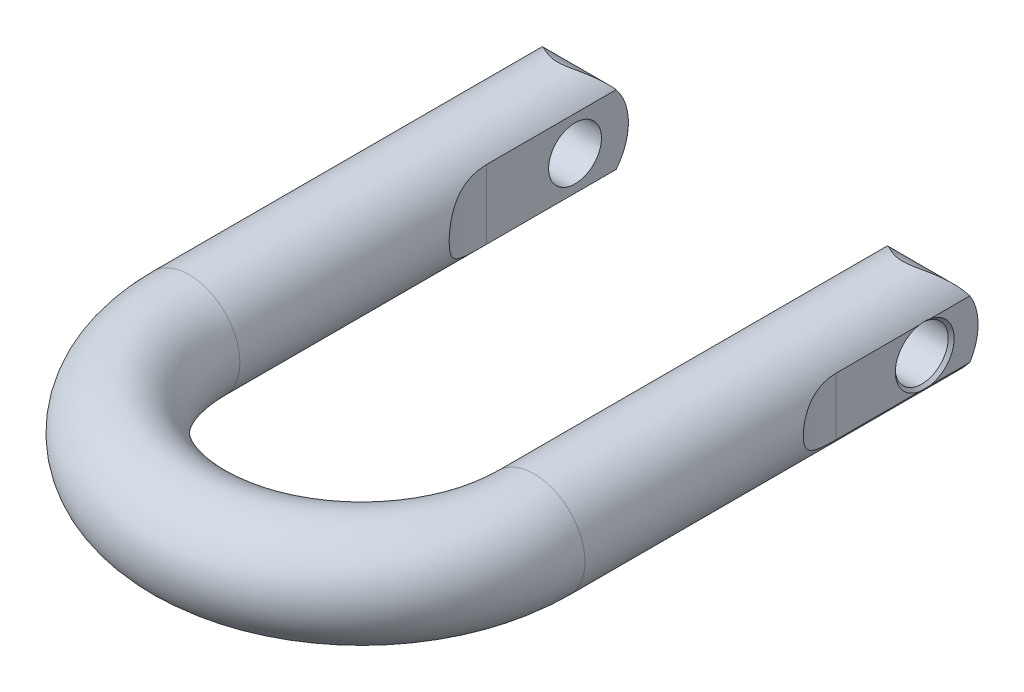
ISO-10303-21;
HEADER;
FILE_DESCRIPTION(('STEP AP214'),'2;1');
FILE_NAME('part.step','',(''),(''),'','','');
FILE_SCHEMA(('AUTOMOTIVE_DESIGN { 1 0 10303 214 1 1 1 1 }'));
ENDSEC;
DATA;
#1=APPLICATION_CONTEXT('core data for automotive mechanical design processes');
#2=APPLICATION_PROTOCOL_DEFINITION('international standard','automotive_design',2000,#1);
#3=PRODUCT_CONTEXT('',#1,'mechanical');
#4=PRODUCT('Part','Part','',(#3));
#5=PRODUCT_RELATED_PRODUCT_CATEGORY('part','',(#4));
#6=PRODUCT_DEFINITION_FORMATION('','',#4);
#7=PRODUCT_DEFINITION_CONTEXT('part definition',#1,'design');
#8=PRODUCT_DEFINITION('design','',#6,#7);
#9=PRODUCT_DEFINITION_SHAPE('','',#8);
#10=(LENGTH_UNIT() NAMED_UNIT(*) SI_UNIT(.MILLI.,.METRE.));
#11=(NAMED_UNIT(*) PLANE_ANGLE_UNIT() SI_UNIT($,.RADIAN.));
#12=(NAMED_UNIT(*) SI_UNIT($,.STERADIAN.) SOLID_ANGLE_UNIT());
#13=UNCERTAINTY_MEASURE_WITH_UNIT(LENGTH_MEASURE(1.E-05),#10,'distance_accuracy_value','');
#14=(GEOMETRIC_REPRESENTATION_CONTEXT(3) GLOBAL_UNCERTAINTY_ASSIGNED_CONTEXT((#13)) GLOBAL_UNIT_ASSIGNED_CONTEXT((#10,
#11,#12)) REPRESENTATION_CONTEXT('',''));
#15=CARTESIAN_POINT('',(0.,0.,0.));
#16=DIRECTION('',(0.,0.,1.));
#17=DIRECTION('',(1.,0.,0.));
#18=AXIS2_PLACEMENT_3D('',#15,#16,#17);
#19=CARTESIAN_POINT('',(39.6748,0.,0.));
#20=DIRECTION('',(-1.,0.,0.));
#21=DIRECTION('',(0.,-1.,0.));
#22=AXIS2_PLACEMENT_3D('',#19,#20,#21);
#23=CYLINDRICAL_SURFACE('',#22,4.9657);
#24=CARTESIAN_POINT('',(39.6748,0.,0.));
#25=DIRECTION('',(1.,0.,0.));
#26=DIRECTION('',(0.,1.,0.));
#27=AXIS2_PLACEMENT_3D('',#24,#25,#26);
#28=CIRCLE('',#27,4.9657);
#29=CARTESIAN_POINT('',(39.6748,4.9657,0.));
#30=VERTEX_POINT('',#29);
#31=EDGE_CURVE('E270',#30,#30,#28,.F.);
#32=ORIENTED_EDGE('',*,*,#31,.F.);
#33=EDGE_LOOP('',(#32));
#34=FACE_BOUND('',#33,.T.);
#35=CARTESIAN_POINT('',(25.4254,0.,0.));
#36=DIRECTION('',(-1.,0.,0.));
#37=DIRECTION('',(0.,-1.,0.));
#38=AXIS2_PLACEMENT_3D('',#35,#36,#37);
#39=CIRCLE('',#38,4.9657);
#40=CARTESIAN_POINT('',(25.4254,-4.9657,0.));
#41=VERTEX_POINT('',#40);
#42=EDGE_CURVE('E109',#41,#41,#39,.T.);
#43=ORIENTED_EDGE('',*,*,#42,.T.);
#44=EDGE_LOOP('',(#43));
#45=FACE_BOUND('',#44,.T.);
#46=ADVANCED_FACE('F14',(#34,#45),#23,.F.);
#47=CARTESIAN_POINT('',(-25.4254,0.,0.));
#48=DIRECTION('',(-1.,0.,0.));
#49=DIRECTION('',(0.,0.,1.));
#50=AXIS2_PLACEMENT_3D('',#47,#48,#49);
#51=CYLINDRICAL_SURFACE('',#50,4.9657);
#52=CARTESIAN_POINT('',(-39.6748,0.,0.));
#53=DIRECTION('',(-1.,0.,0.));
#54=DIRECTION('',(0.,-1.,0.));
#55=AXIS2_PLACEMENT_3D('',#52,#53,#54);
#56=CIRCLE('',#55,4.9657);
#57=CARTESIAN_POINT('',(-39.6748,-4.9657,0.));
#58=VERTEX_POINT('',#57);
#59=EDGE_CURVE('E201',#58,#58,#56,.T.);
#60=ORIENTED_EDGE('',*,*,#59,.T.);
#61=EDGE_LOOP('',(#60));
#62=FACE_BOUND('',#61,.T.);
#63=CARTESIAN_POINT('',(-25.4254,0.,0.));
#64=DIRECTION('',(-1.,0.,0.));
#65=DIRECTION('',(0.,0.,1.));
#66=AXIS2_PLACEMENT_3D('',#63,#64,#65);
#67=CIRCLE('',#66,4.9657);
#68=CARTESIAN_POINT('',(-25.4254,0.,4.9657));
#69=VERTEX_POINT('',#68);
#70=EDGE_CURVE('E222',#69,#69,#67,.F.);
#71=ORIENTED_EDGE('',*,*,#70,.T.);
#72=EDGE_LOOP('',(#71));
#73=FACE_BOUND('',#72,.T.);
#74=ADVANCED_FACE('F192',(#62,#73),#51,.F.);
#75=CARTESIAN_POINT('',(0.,0.,65.4812));
#76=DIRECTION('',(0.,-1.,0.));
#77=DIRECTION('',(1.,0.,0.));
#78=AXIS2_PLACEMENT_3D('',#75,#76,#77);
#79=TOROIDAL_SURFACE('',#78,32.3977,9.525);
#80=CARTESIAN_POINT('',(-32.3977,0.,65.4812));
#81=DIRECTION('',(0.,0.,1.));
#82=DIRECTION('',(0.,1.,0.));
#83=AXIS2_PLACEMENT_3D('',#80,#81,#82);
#84=CIRCLE('',#83,9.525);
#85=CARTESIAN_POINT('',(-32.3977,9.525,65.4812));
#86=VERTEX_POINT('',#85);
#87=EDGE_CURVE('E9',#86,#86,#84,.T.);
#88=ORIENTED_EDGE('',*,*,#87,.T.);
#89=EDGE_LOOP('',(#88));
#90=FACE_BOUND('',#89,.T.);
#91=CARTESIAN_POINT('',(32.3977,0.,65.4812));
#92=DIRECTION('',(0.,0.,1.));
#93=DIRECTION('',(0.,1.,0.));
#94=AXIS2_PLACEMENT_3D('',#91,#92,#93);
#95=CIRCLE('',#94,9.525);
#96=CARTESIAN_POINT('',(32.3977,9.525,65.4812));
#97=VERTEX_POINT('',#96);
#98=EDGE_CURVE('E30',#97,#97,#95,.T.);
#99=ORIENTED_EDGE('',*,*,#98,.T.);
#100=EDGE_LOOP('',(#99));
#101=FACE_BOUND('',#100,.T.);
#102=ADVANCED_FACE('F16',(#90,#101),#79,.T.);
#103=CARTESIAN_POINT('',(-6.3754,-6.5672997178,16.6497));
#104=DIRECTION('',(0.,1.,0.));
#105=DIRECTION('',(-1.,0.,0.));
#106=AXIS2_PLACEMENT_3D('',#103,#104,#105);
#107=CYLINDRICAL_SURFACE('',#106,19.05);
#108=DIRECTION('',(0.,-1.,0.));
#109=VECTOR('',#108,1.);
#110=CARTESIAN_POINT('',(-25.4254,0.,16.6497));
#111=LINE('',#110,#109);
#112=CARTESIAN_POINT('',(-25.4254000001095,-6.48942660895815,16.6497000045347));
#113=VERTEX_POINT('',#112);
#114=CARTESIAN_POINT('',(-25.4254000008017,6.48942660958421,16.6497));
#115=VERTEX_POINT('',#114);
#116=EDGE_CURVE('E224',#113,#115,#111,.F.);
#117=ORIENTED_EDGE('',*,*,#116,.T.);
#118=CARTESIAN_POINT('',(-25.4254,6.48942660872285,16.649700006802));
#119=CARTESIAN_POINT('',(-25.4254031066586,6.48941915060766,16.8191491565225));
#120=CARTESIAN_POINT('',(-25.4231391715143,6.48699726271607,16.9885981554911));
#121=CARTESIAN_POINT('',(-25.4140999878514,6.47727078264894,17.3272427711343));
#122=CARTESIAN_POINT('',(-25.4073245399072,6.46996597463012,17.4964383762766));
#123=CARTESIAN_POINT('',(-25.3892753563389,6.45040923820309,17.8344906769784));
#124=CARTESIAN_POINT('',(-25.3779967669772,6.43815197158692,18.0033468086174));
#125=CARTESIAN_POINT('',(-25.3509928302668,6.40858295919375,18.3402468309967));
#126=CARTESIAN_POINT('',(-25.3352675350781,6.39127127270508,18.5082907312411));
#127=CARTESIAN_POINT('',(-25.2811865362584,6.33118214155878,19.0138506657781));
#128=CARTESIAN_POINT('',(-25.2360883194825,6.28041976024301,19.3497645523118));
#129=CARTESIAN_POINT('',(-25.1289138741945,6.15606363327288,20.0144349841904));
#130=CARTESIAN_POINT('',(-25.0668465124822,6.08248180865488,20.3431951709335));
#131=CARTESIAN_POINT('',(-24.9446248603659,5.9316247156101,20.9097679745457));
#132=CARTESIAN_POINT('',(-24.8878642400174,5.85986156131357,21.1497882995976));
#133=CARTESIAN_POINT('',(-24.7664754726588,5.70088207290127,21.6226659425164));
#134=CARTESIAN_POINT('',(-24.701847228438,5.61366554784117,21.8555231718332));
#135=CARTESIAN_POINT('',(-24.5661410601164,5.42272814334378,22.3114874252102));
#136=CARTESIAN_POINT('',(-24.4950851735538,5.31906280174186,22.5346241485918));
#137=CARTESIAN_POINT('',(-24.3479218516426,5.09360536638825,22.9697990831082));
#138=CARTESIAN_POINT('',(-24.271816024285,4.97181902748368,23.1818407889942));
#139=CARTESIAN_POINT('',(-24.1369128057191,4.7431755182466,23.5386383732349));
#140=CARTESIAN_POINT('',(-24.078792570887,4.64074027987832,23.6864914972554));
#141=CARTESIAN_POINT('',(-23.9619532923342,4.42480243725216,23.9736090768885));
#142=CARTESIAN_POINT('',(-23.9032343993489,4.31130256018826,24.1128756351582));
#143=CARTESIAN_POINT('',(-23.7864121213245,4.07295041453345,24.3814907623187));
#144=CARTESIAN_POINT('',(-23.7283083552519,3.94810569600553,24.5108458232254));
#145=CARTESIAN_POINT('',(-23.6140719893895,3.68698466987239,24.7582933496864));
#146=CARTESIAN_POINT('',(-23.5579390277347,3.55071047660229,24.8763878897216));
#147=CARTESIAN_POINT('',(-23.4149196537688,3.17747214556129,25.1701518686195));
#148=CARTESIAN_POINT('',(-23.3308259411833,2.93096224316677,25.335476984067));
#149=CARTESIAN_POINT('',(-23.2169020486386,2.54106543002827,25.5532440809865));
#150=CARTESIAN_POINT('',(-23.1809506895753,2.40768274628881,25.6208189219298));
#151=CARTESIAN_POINT('',(-23.1139595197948,2.13482510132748,25.7451986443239));
#152=CARTESIAN_POINT('',(-23.082917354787,1.9953531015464,25.8020086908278));
#153=CARTESIAN_POINT('',(-23.0256456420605,1.70662532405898,25.9058038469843));
#154=CARTESIAN_POINT('',(-22.9996007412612,1.55719943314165,25.9524186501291));
#155=CARTESIAN_POINT('',(-22.9543513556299,1.25391083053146,26.0328233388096));
#156=CARTESIAN_POINT('',(-22.9351469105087,1.10004809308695,26.0666131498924));
#157=CARTESIAN_POINT('',(-22.9041732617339,0.789273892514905,26.1208739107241));
#158=CARTESIAN_POINT('',(-22.8924028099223,0.632362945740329,26.1413470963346));
#159=CARTESIAN_POINT('',(-22.8766662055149,0.316968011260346,26.168679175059));
#160=CARTESIAN_POINT('',(-22.8726999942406,0.158484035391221,26.175538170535));
#161=CARTESIAN_POINT('',(-22.8727000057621,-0.158558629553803,26.1755381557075));
#162=CARTESIAN_POINT('',(-22.8766699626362,-0.317117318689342,26.1686726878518));
#163=CARTESIAN_POINT('',(-22.8924212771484,-0.632658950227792,26.1413149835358));
#164=CARTESIAN_POINT('',(-22.9042026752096,-0.789641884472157,26.1208226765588));
#165=CARTESIAN_POINT('',(-22.9352053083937,-1.10056092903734,26.0665105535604));
#166=CARTESIAN_POINT('',(-22.9544280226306,-1.25449642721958,26.0326880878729));
#167=CARTESIAN_POINT('',(-22.9997198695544,-1.55792584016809,25.9522059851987));
#168=CARTESIAN_POINT('',(-23.0257890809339,-1.7074197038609,25.9055462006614));
#169=CARTESIAN_POINT('',(-23.0838309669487,-1.99988774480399,25.8003506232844));
#170=CARTESIAN_POINT('',(-23.1157658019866,-2.14289677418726,25.7418907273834));
#171=CARTESIAN_POINT('',(-23.184776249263,-2.42248705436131,25.6136663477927));
#172=CARTESIAN_POINT('',(-23.2218545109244,-2.55906494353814,25.5438960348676));
#173=CARTESIAN_POINT('',(-23.3394100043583,-2.95798109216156,25.3188031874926));
#174=CARTESIAN_POINT('',(-23.4262573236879,-3.20973857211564,25.1476120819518));
#175=CARTESIAN_POINT('',(-23.5743427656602,-3.59148121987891,24.8421266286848));
#176=CARTESIAN_POINT('',(-23.6327938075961,-3.73142424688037,24.7184803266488));
#177=CARTESIAN_POINT('',(-23.7516229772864,-3.99904556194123,24.4592882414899));
#178=CARTESIAN_POINT('',(-23.8120015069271,-4.12672126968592,24.3237399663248));
#179=CARTESIAN_POINT('',(-23.9332094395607,-4.36995768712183,24.0422191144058));
#180=CARTESIAN_POINT('',(-23.9940391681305,-4.48550850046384,23.8962381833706));
#181=CARTESIAN_POINT('',(-24.1148288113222,-4.70482060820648,23.5953085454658));
#182=CARTESIAN_POINT('',(-24.174788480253,-4.80857862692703,23.4403573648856));
#183=CARTESIAN_POINT('',(-24.3142336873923,-5.04059925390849,23.0648461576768));
#184=CARTESIAN_POINT('',(-24.3928687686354,-5.1640055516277,22.8409612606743));
#185=CARTESIAN_POINT('',(-24.5442221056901,-5.39139740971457,22.381624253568));
#186=CARTESIAN_POINT('',(-24.6169382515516,-5.49537606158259,22.1461680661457));
#187=CARTESIAN_POINT('',(-24.7549729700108,-5.68579087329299,21.6653303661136));
#188=CARTESIAN_POINT('',(-24.8202686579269,-5.77217338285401,21.4199211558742));
#189=CARTESIAN_POINT('',(-24.9419735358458,-5.92853883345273,20.9217764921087));
#190=CARTESIAN_POINT('',(-24.9983809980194,-5.99851858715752,20.6690396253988));
#191=CARTESIAN_POINT('',(-25.1113421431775,-6.13546885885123,20.1085539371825));
#192=CARTESIAN_POINT('',(-25.1658211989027,-6.19924952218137,19.799605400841));
#193=CARTESIAN_POINT('',(-25.2597799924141,-6.30720410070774,19.1760041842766));
#194=CARTESIAN_POINT('',(-25.2992548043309,-6.35137157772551,18.8613496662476));
#195=CARTESIAN_POINT('',(-25.3622549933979,-6.42108503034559,18.2312140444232));
#196=CARTESIAN_POINT('',(-25.3859175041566,-6.44679126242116,17.9157645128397));
#197=CARTESIAN_POINT('',(-25.409596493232,-6.4724143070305,17.441490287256));
#198=CARTESIAN_POINT('',(-25.4155203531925,-6.47879929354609,17.2832622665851));
#199=CARTESIAN_POINT('',(-25.4234225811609,-6.48730290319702,16.9665943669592));
#200=CARTESIAN_POINT('',(-25.4254009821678,-6.48942156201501,16.8081544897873));
#201=CARTESIAN_POINT('',(-25.4254,-6.48942660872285,16.6497000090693));
#202=B_SPLINE_CURVE_WITH_KNOTS('',3,(#118,#119,#120,#121,#122,#123,#124,#125,#126,#127,#128,
#129,#130,#131,#132,#133,#134,#135,#136,#137,#138,#139,#140,#141,#142,#143,#144,#145,#146,#147,
#148,#149,#150,#151,#152,#153,#154,#155,#156,#157,#158,#159,#160,#161,#162,#163,#164,#165,#166,
#167,#168,#169,#170,#171,#172,#173,#174,#175,#176,#177,#178,#179,#180,#181,#182,#183,#184,#185,
#186,#187,#188,#189,#190,#191,#192,#193,#194,#195,#196,#197,#198,#199,#200,#201),.UNSPECIFIED.,
.F.,.F.,(4,2,2,2,2,2,2,2,2,2,2,2,2,2,2,2,2,2,2,2,2,2,2,2,2,2,2,2,2,2,2,2,2,2,2,2,2,2,2,2,2,4),
(0.,0.508314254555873,1.01665097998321,1.52553710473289,2.03441726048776,3.06126918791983,
4.08758558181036,4.85757931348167,5.62758255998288,6.39503922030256,7.16225267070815,
7.72887307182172,8.29535416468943,8.86146098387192,9.42746330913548,10.348457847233,
10.809352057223,11.2700245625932,11.745361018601,12.2207002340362,12.6959596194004,
13.1712154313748,13.6466949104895,14.1221768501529,14.597753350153,15.0733353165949,
15.5459506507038,16.0188103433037,16.963769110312,17.550162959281,18.136679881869,
18.7236718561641,19.3108264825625,20.1120324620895,20.9135228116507,21.717421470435,
22.5214762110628,23.4807776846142,24.4403938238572,25.3915756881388,25.8668870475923,
26.342194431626),.UNSPECIFIED.);
#203=EDGE_CURVE('E236',#115,#113,#202,.T.);
#204=ORIENTED_EDGE('',*,*,#203,.T.);
#205=EDGE_LOOP('',(#117,#204));
#206=FACE_BOUND('',#205,.T.);
#207=ADVANCED_FACE('F146',(#206),#107,.F.);
#208=CARTESIAN_POINT('',(-25.4254,-6.4894266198,-10.18032));
#209=DIRECTION('',(-1.,0.,0.));
#210=DIRECTION('',(0.,0.,1.));
#211=AXIS2_PLACEMENT_3D('',#208,#209,#210);
#212=PLANE('',#211);
#213=ORIENTED_EDGE('',*,*,#70,.F.);
#214=EDGE_LOOP('',(#213));
#215=FACE_BOUND('',#214,.T.);
#216=CARTESIAN_POINT('',(-25.4254,0.,0.29845));
#217=DIRECTION('',(-1.,0.,0.));
#218=DIRECTION('',(0.,0.,1.));
#219=AXIS2_PLACEMENT_3D('',#216,#217,#218);
#220=CIRCLE('',#219,10.31875);
#221=CARTESIAN_POINT('',(-25.4253999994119,6.48942660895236,-7.72426424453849));
#222=VERTEX_POINT('',#221);
#223=CARTESIAN_POINT('',(-25.425400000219,-6.48942660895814,-7.72426424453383));
#224=VERTEX_POINT('',#223);
#225=EDGE_CURVE('E221',#222,#224,#220,.T.);
#226=ORIENTED_EDGE('',*,*,#225,.F.);
#227=DIRECTION('',(0.,0.,-1.));
#228=VECTOR('',#227,1.);
#229=CARTESIAN_POINT('',(-25.4254000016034,6.48942661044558,28.2761065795));
#230=LINE('',#229,#228);
#231=EDGE_CURVE('E39',#222,#115,#230,.F.);
#232=ORIENTED_EDGE('',*,*,#231,.T.);
#233=ORIENTED_EDGE('',*,*,#116,.F.);
#234=DIRECTION('',(0.,0.,1.));
#235=VECTOR('',#234,1.);
#236=CARTESIAN_POINT('',(-25.425400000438,-6.48942660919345,28.2761065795));
#237=LINE('',#236,#235);
#238=EDGE_CURVE('E262',#113,#224,#237,.F.);
#239=ORIENTED_EDGE('',*,*,#238,.T.);
#240=EDGE_LOOP('',(#226,#232,#233,#239));
#241=FACE_BOUND('',#240,.T.);
#242=ADVANCED_FACE('F290',(#215,#241),#212,.F.);
#243=CARTESIAN_POINT('',(-25.4254,0.,0.29845));
#244=DIRECTION('',(-1.,0.,0.));
#245=DIRECTION('',(0.,0.,1.));
#246=AXIS2_PLACEMENT_3D('',#243,#244,#245);
#247=CYLINDRICAL_SURFACE('',#246,10.31875);
#248=ORIENTED_EDGE('',*,*,#225,.T.);
#249=CARTESIAN_POINT('',(-25.4253999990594,-6.4894266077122,-7.72426424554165));
#250=CARTESIAN_POINT('',(-25.5440311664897,-6.61687092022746,-7.62117736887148));
#251=CARTESIAN_POINT('',(-25.6654091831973,-6.74028756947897,-7.51632378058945));
#252=CARTESIAN_POINT('',(-25.9133461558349,-6.97914404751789,-7.30376692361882));
#253=CARTESIAN_POINT('',(-26.0399040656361,-7.09458547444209,-7.19606423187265));
#254=CARTESIAN_POINT('',(-26.2980405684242,-7.31771156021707,-6.97836273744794));
#255=CARTESIAN_POINT('',(-26.4296231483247,-7.42538985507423,-6.86836214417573));
#256=CARTESIAN_POINT('',(-26.697533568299,-7.63298318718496,-6.6468534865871));
#257=CARTESIAN_POINT('',(-26.8338616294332,-7.73289786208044,-6.53534535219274));
#258=CARTESIAN_POINT('',(-27.2517838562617,-8.02251644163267,-6.19800168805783));
#259=CARTESIAN_POINT('',(-27.5405571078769,-8.20057881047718,-5.97084674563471));
#260=CARTESIAN_POINT('',(-27.9882141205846,-8.44457521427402,-5.63325288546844));
#261=CARTESIAN_POINT('',(-28.1398109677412,-8.52204190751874,-5.52127134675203));
#262=CARTESIAN_POINT('',(-28.4482651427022,-8.66930284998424,-5.29953734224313));
#263=CARTESIAN_POINT('',(-28.6051214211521,-8.7390986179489,-5.18978443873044));
#264=CARTESIAN_POINT('',(-28.8894101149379,-8.85639154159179,-4.9978369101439));
#265=CARTESIAN_POINT('',(-29.0157123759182,-8.90541381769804,-4.91489756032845));
#266=CARTESIAN_POINT('',(-29.2721532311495,-8.99862193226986,-4.75231029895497));
#267=CARTESIAN_POINT('',(-29.4022913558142,-9.04280835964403,-4.67266198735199));
#268=CARTESIAN_POINT('',(-29.6667994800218,-9.12617299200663,-4.51790565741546));
#269=CARTESIAN_POINT('',(-29.8011686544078,-9.16535216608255,-4.44279676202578));
#270=CARTESIAN_POINT('',(-30.0745611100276,-9.23843398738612,-4.2987753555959));
#271=CARTESIAN_POINT('',(-30.2135839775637,-9.27233710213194,-4.22986229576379));
#272=CARTESIAN_POINT('',(-30.5885153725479,-9.35465748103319,-4.05825571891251));
#273=CARTESIAN_POINT('',(-30.8288688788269,-9.39825775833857,-3.96258310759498));
#274=CARTESIAN_POINT('',(-31.3229666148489,-9.46742724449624,-3.80665900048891));
#275=CARTESIAN_POINT('',(-31.5766551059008,-9.49306594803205,-3.74627113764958));
#276=CARTESIAN_POINT('',(-32.0477882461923,-9.52096514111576,-3.68011048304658));
#277=CARTESIAN_POINT('',(-32.2639177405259,-9.52650066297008,-3.6667014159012));
#278=CARTESIAN_POINT('',(-32.6953291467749,-9.52279471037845,-3.67558947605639));
#279=CARTESIAN_POINT('',(-32.9106107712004,-9.51354859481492,-3.6978978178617));
#280=CARTESIAN_POINT('',(-33.3951128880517,-9.47658537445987,-3.78488690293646));
#281=CARTESIAN_POINT('',(-33.662052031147,-9.444323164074,-3.8599034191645));
#282=CARTESIAN_POINT('',(-34.1804215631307,-9.36040623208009,-4.04546433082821));
#283=CARTESIAN_POINT('',(-34.43177846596,-9.30866672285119,-4.15616375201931));
#284=CARTESIAN_POINT('',(-34.9150246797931,-9.18963731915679,-4.39675355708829));
#285=CARTESIAN_POINT('',(-35.1471813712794,-9.12264143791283,-4.52626617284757));
#286=CARTESIAN_POINT('',(-35.5994401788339,-8.97391796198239,-4.79756687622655));
#287=CARTESIAN_POINT('',(-35.8195299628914,-8.89217564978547,-4.93936715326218));
#288=CARTESIAN_POINT('',(-36.24970876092,-8.71446429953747,-5.23000593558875));
#289=CARTESIAN_POINT('',(-36.4597766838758,-8.61846686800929,-5.37885807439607));
#290=CARTESIAN_POINT('',(-36.8705288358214,-8.41261905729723,-5.67964918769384));
#291=CARTESIAN_POINT('',(-37.0712167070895,-8.30277411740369,-5.83158693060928));
#292=CARTESIAN_POINT('',(-37.4924067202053,-8.0522071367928,-6.15808408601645));
#293=CARTESIAN_POINT('',(-37.7115584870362,-7.90931750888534,-6.3327269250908));
#294=CARTESIAN_POINT('',(-38.1386793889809,-7.60496815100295,-6.67968410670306));
#295=CARTESIAN_POINT('',(-38.346645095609,-7.44350277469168,-6.85199772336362));
#296=CARTESIAN_POINT('',(-38.7500961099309,-7.10226999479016,-7.19101011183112));
#297=CARTESIAN_POINT('',(-38.945623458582,-6.92257022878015,-7.35772678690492));
#298=CARTESIAN_POINT('',(-39.3239390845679,-6.54403453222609,-7.68369033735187));
#299=CARTESIAN_POINT('',(-39.5067313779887,-6.34520468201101,-7.84293956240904));
#300=CARTESIAN_POINT('',(-39.7787366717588,-6.02231616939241,-8.08179845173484));
#301=CARTESIAN_POINT('',(-39.8729487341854,-5.90501464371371,-8.16491160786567));
#302=CARTESIAN_POINT('',(-40.0567944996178,-5.66452099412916,-8.32772470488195));
#303=CARTESIAN_POINT('',(-40.1464266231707,-5.54132686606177,-8.40742346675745));
#304=CARTESIAN_POINT('',(-40.2335999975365,-5.41519124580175,-8.48518850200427));
#305=B_SPLINE_CURVE_WITH_KNOTS('',3,(#249,#250,#251,#252,#253,#254,#255,#256,#257,#258,#259,
#260,#261,#262,#263,#264,#265,#266,#267,#268,#269,#270,#271,#272,#273,#274,#275,#276,#277,#278,
#279,#280,#281,#282,#283,#284,#285,#286,#287,#288,#289,#290,#291,#292,#293,#294,#295,#296,#297,
#298,#299,#300,#301,#302,#303,#304),.UNSPECIFIED.,.F.,.F.,(4,2,2,2,2,2,2,2,2,2,2,2,2,2,2,2,2,2,
2,2,2,2,2,2,2,2,2,4),(0.,0.606920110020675,1.21371824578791,1.82100829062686,2.42832666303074,
3.65122867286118,4.26238466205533,4.87341943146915,5.34984834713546,5.82621917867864,
6.30249767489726,6.7787339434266,7.56334625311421,8.34490581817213,8.99136642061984,
9.63803003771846,10.4705576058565,11.3067520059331,12.1280225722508,12.9501173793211,
13.773872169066,14.5973043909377,15.5402196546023,16.4834222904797,17.4232459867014,
18.3627719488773,18.8782417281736,19.3938880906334),.UNSPECIFIED.);
#306=CARTESIAN_POINT('',(-40.2335999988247,-5.41519124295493,-8.48518850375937));
#307=VERTEX_POINT('',#306);
#308=EDGE_CURVE('E261',#224,#307,#305,.T.);
#309=ORIENTED_EDGE('',*,*,#308,.T.);
#310=CARTESIAN_POINT('',(-40.2336,0.,0.29845));
#311=DIRECTION('',(-1.,0.,0.));
#312=DIRECTION('',(0.,0.,1.));
#313=AXIS2_PLACEMENT_3D('',#310,#311,#312);
#314=CIRCLE('',#313,10.31875);
#315=CARTESIAN_POINT('',(-40.2336000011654,5.41519124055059,-8.48518850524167));
#316=VERTEX_POINT('',#315);
#317=EDGE_CURVE('E219',#316,#307,#314,.T.);
#318=ORIENTED_EDGE('',*,*,#317,.F.);
#319=CARTESIAN_POINT('',(-40.2335999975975,5.41519124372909,-8.48518850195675));
#320=CARTESIAN_POINT('',(-40.1302881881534,5.56467323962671,-8.39302798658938));
#321=CARTESIAN_POINT('',(-40.0235360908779,5.71001359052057,-8.29816129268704));
#322=CARTESIAN_POINT('',(-39.8036804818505,5.9924216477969,-8.10374501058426));
#323=CARTESIAN_POINT('',(-39.690579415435,6.12949249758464,-8.0041972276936));
#324=CARTESIAN_POINT('',(-39.3427974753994,6.52805447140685,-7.69984395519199));
#325=CARTESIAN_POINT('',(-39.0993015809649,6.7773765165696,-7.48902690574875));
#326=CARTESIAN_POINT('',(-38.5902145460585,7.24561448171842,-7.05547777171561));
#327=CARTESIAN_POINT('',(-38.3244793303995,7.46430290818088,-6.83267196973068));
#328=CARTESIAN_POINT('',(-37.7738541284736,7.87017442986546,-6.38202500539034));
#329=CARTESIAN_POINT('',(-37.4889632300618,8.05735602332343,-6.15418360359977));
#330=CARTESIAN_POINT('',(-37.0032649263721,8.34046116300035,-5.77999381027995));
#331=CARTESIAN_POINT('',(-36.8080358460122,8.44535782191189,-5.63310677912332));
#332=CARTESIAN_POINT('',(-36.4087545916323,8.64214296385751,-5.34253499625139));
#333=CARTESIAN_POINT('',(-36.2047018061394,8.73403054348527,-5.19885046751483));
#334=CARTESIAN_POINT('',(-35.7873588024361,8.90429637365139,-4.91853113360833));
#335=CARTESIAN_POINT('',(-35.5740998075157,8.98271639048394,-4.78187548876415));
#336=CARTESIAN_POINT('',(-35.1362148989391,9.12574251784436,-4.52022053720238));
#337=CARTESIAN_POINT('',(-34.9115993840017,9.19036099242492,-4.39521085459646));
#338=CARTESIAN_POINT('',(-34.4604941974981,9.30170541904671,-4.17030857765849));
#339=CARTESIAN_POINT('',(-34.234674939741,9.34917150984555,-4.06946488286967));
#340=CARTESIAN_POINT('',(-33.7701368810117,9.42853274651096,-3.89542399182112));
#341=CARTESIAN_POINT('',(-33.5314531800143,9.46046809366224,-3.82215552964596));
#342=CARTESIAN_POINT('',(-33.0791046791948,9.50289219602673,-3.72326651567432));
#343=CARTESIAN_POINT('',(-32.8669075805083,9.51584023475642,-3.69223206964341));
#344=CARTESIAN_POINT('',(-32.4399576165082,9.52729247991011,-3.66482936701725));
#345=CARTESIAN_POINT('',(-32.2252074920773,9.52581098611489,-3.66842678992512));
#346=CARTESIAN_POINT('',(-31.8004871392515,9.50863288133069,-3.70940540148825));
#347=CARTESIAN_POINT('',(-31.5905030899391,9.49298484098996,-3.74667115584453));
#348=CARTESIAN_POINT('',(-31.1785348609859,9.44893579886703,-3.84850113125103));
#349=CARTESIAN_POINT('',(-30.9765677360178,9.42050904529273,-3.9131204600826));
#350=CARTESIAN_POINT('',(-30.5904790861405,9.35394971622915,-4.05888365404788));
#351=CARTESIAN_POINT('',(-30.4059645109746,9.31627237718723,-4.13922413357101));
#352=CARTESIAN_POINT('',(-30.0450450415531,9.23174023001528,-4.31250198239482));
#353=CARTESIAN_POINT('',(-29.8686478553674,9.18487691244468,-4.40545100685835));
#354=CARTESIAN_POINT('',(-29.5220665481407,9.08235810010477,-4.60048877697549));
#355=CARTESIAN_POINT('',(-29.3519314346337,9.02664631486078,-4.70263408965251));
#356=CARTESIAN_POINT('',(-29.0182299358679,8.90708750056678,-4.91259583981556));
#357=CARTESIAN_POINT('',(-28.8546624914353,8.84324179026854,-5.02041135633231));
#358=CARTESIAN_POINT('',(-28.5367023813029,8.70904516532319,-5.23734828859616));
#359=CARTESIAN_POINT('',(-28.3821893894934,8.63885818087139,-5.3463952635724));
#360=CARTESIAN_POINT('',(-28.0782651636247,8.4909749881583,-5.56649282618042));
#361=CARTESIAN_POINT('',(-27.9288547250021,8.41327761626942,-5.67754372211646));
#362=CARTESIAN_POINT('',(-27.4876108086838,8.16883677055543,-6.01208682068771));
#363=CARTESIAN_POINT('',(-27.2028750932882,7.99079139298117,-6.23689204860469));
#364=CARTESIAN_POINT('',(-26.79307499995,7.70329041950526,-6.56862642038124));
#365=CARTESIAN_POINT('',(-26.660891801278,7.60538274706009,-6.67698431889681));
#366=CARTESIAN_POINT('',(-26.4010275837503,7.40221308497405,-6.89221865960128));
#367=CARTESIAN_POINT('',(-26.2733463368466,7.29695146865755,-6.99909517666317));
#368=CARTESIAN_POINT('',(-26.0227342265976,7.07905331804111,-7.21065510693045));
#369=CARTESIAN_POINT('',(-25.8998004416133,6.96642143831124,-7.31533985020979));
#370=CARTESIAN_POINT('',(-25.6588431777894,6.7336070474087,-7.52199565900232));
#371=CARTESIAN_POINT('',(-25.5408206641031,6.61342306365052,-7.6239661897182));
#372=CARTESIAN_POINT('',(-25.4253999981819,6.48942660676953,-7.72426424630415));
#373=B_SPLINE_CURVE_WITH_KNOTS('',3,(#319,#320,#321,#322,#323,#324,#325,#326,#327,#328,#329,
#330,#331,#332,#333,#334,#335,#336,#337,#338,#339,#340,#341,#342,#343,#344,#345,#346,#347,#348,
#349,#350,#351,#352,#353,#354,#355,#356,#357,#358,#359,#360,#361,#362,#363,#364,#365,#366,#367,
#368,#369,#370,#371,#372),.UNSPECIFIED.,.F.,.F.,(4,2,2,2,2,2,2,2,2,2,2,2,2,2,2,2,2,2,2,2,2,2,2,
2,2,2,4),(0.,0.611024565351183,1.22181538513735,2.44142693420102,3.66966328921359,
4.89795817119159,5.69519799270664,6.49249315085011,7.28726920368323,8.08133024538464,
8.83519615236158,9.58710015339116,10.2286783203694,10.8696207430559,11.5083739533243,
12.1484201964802,12.7617196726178,13.3755899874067,13.9935346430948,14.6113792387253,
15.2163052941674,15.8213252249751,17.0317917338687,17.6225806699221,18.2133396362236,
18.8037290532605,19.3942339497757),.UNSPECIFIED.);
#374=EDGE_CURVE('E237',#316,#222,#373,.T.);
#375=ORIENTED_EDGE('',*,*,#374,.T.);
#376=EDGE_LOOP('',(#248,#309,#318,#375));
#377=FACE_BOUND('',#376,.T.);
#378=ADVANCED_FACE('F287',(#377),#247,.T.);
#379=CARTESIAN_POINT('',(-40.2336,-5.4151912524,-1.0399676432));
#380=DIRECTION('',(1.,0.,0.));
#381=DIRECTION('',(0.,0.,-1.));
#382=AXIS2_PLACEMENT_3D('',#379,#380,#381);
#383=PLANE('',#382);
#384=DIRECTION('',(0.,0.,-1.));
#385=VECTOR('',#384,1.);
#386=CARTESIAN_POINT('',(-40.2336000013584,-5.41519124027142,28.2761065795));
#387=LINE('',#386,#385);
#388=CARTESIAN_POINT('',(-40.2336000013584,-5.41519124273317,-1.0935282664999));
#389=VERTEX_POINT('',#388);
#390=EDGE_CURVE('E258',#307,#389,#387,.F.);
#391=ORIENTED_EDGE('',*,*,#390,.T.);
#392=CARTESIAN_POINT('',(-40.2336,0.,0.));
#393=DIRECTION('',(-1.,0.,0.));
#394=DIRECTION('',(0.,-1.,0.));
#395=AXIS2_PLACEMENT_3D('',#392,#393,#394);
#396=CIRCLE('',#395,5.5245);
#397=CARTESIAN_POINT('',(-40.2336000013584,5.41519124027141,-1.09352827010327));
#398=VERTEX_POINT('',#397);
#399=EDGE_CURVE('E215',#398,#389,#396,.T.);
#400=ORIENTED_EDGE('',*,*,#399,.F.);
#401=DIRECTION('',(0.,0.,1.));
#402=VECTOR('',#401,1.);
#403=CARTESIAN_POINT('',(-40.2336000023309,5.4151912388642,28.2761065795));
#404=LINE('',#403,#402);
#405=EDGE_CURVE('E238',#398,#316,#404,.F.);
#406=ORIENTED_EDGE('',*,*,#405,.T.);
#407=ORIENTED_EDGE('',*,*,#317,.T.);
#408=EDGE_LOOP('',(#391,#400,#406,#407));
#409=FACE_BOUND('',#408,.T.);
#410=ADVANCED_FACE('F190',(#409),#383,.F.);
#411=CARTESIAN_POINT('',(-39.6748,0.,0.));
#412=DIRECTION('',(-1.,0.,0.));
#413=DIRECTION('',(0.,-1.,0.));
#414=AXIS2_PLACEMENT_3D('',#411,#412,#413);
#415=CONICAL_SURFACE('',#414,4.9657,0.785398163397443);
#416=CARTESIAN_POINT('',(-40.2336,0.,0.));
#417=DIRECTION('',(-1.,0.,0.));
#418=DIRECTION('',(0.,-1.,0.));
#419=AXIS2_PLACEMENT_3D('',#416,#417,#418);
#420=CIRCLE('',#419,5.5245);
#421=CARTESIAN_POINT('',(-40.2336000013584,-5.41519124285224,1.09352826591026));
#422=VERTEX_POINT('',#421);
#423=CARTESIAN_POINT('',(-40.2336000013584,5.41519124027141,1.09352827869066));
#424=VERTEX_POINT('',#423);
#425=EDGE_CURVE('E212',#422,#424,#420,.T.);
#426=ORIENTED_EDGE('',*,*,#425,.T.);
#427=CARTESIAN_POINT('',(-40.2336000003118,5.41519124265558,1.0935282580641));
#428=CARTESIAN_POINT('',(-40.218709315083,5.43669163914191,0.912058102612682));
#429=CARTESIAN_POINT('',(-40.2074641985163,5.45282066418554,0.729647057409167));
#430=CARTESIAN_POINT('',(-40.1924772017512,5.47424602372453,0.364820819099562));
#431=CARTESIAN_POINT('',(-40.1886972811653,5.47959728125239,0.182410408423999));
#432=CARTESIAN_POINT('',(-40.1886972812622,5.47959728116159,-0.182410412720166));
#433=CARTESIAN_POINT('',(-40.1924772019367,5.47424602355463,-0.364820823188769));
#434=CARTESIAN_POINT('',(-40.2074641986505,5.45282066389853,-0.729647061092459));
#435=CARTESIAN_POINT('',(-40.218709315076,5.43669163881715,-0.912058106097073));
#436=CARTESIAN_POINT('',(-40.2335999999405,5.41519124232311,-1.09352826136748));
#437=B_SPLINE_CURVE_WITH_KNOTS('',3,(#427,#428,#429,#430,#431,#432,#433,#434,#435,#436),
.UNSPECIFIED.,.F.,.F.,(4,2,2,2,4),(0.,0.549927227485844,1.09704488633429,1.64416254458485,
2.19408977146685),.UNSPECIFIED.);
#438=EDGE_CURVE('E170',#424,#398,#437,.T.);
#439=ORIENTED_EDGE('',*,*,#438,.T.);
#440=ORIENTED_EDGE('',*,*,#399,.T.);
#441=CARTESIAN_POINT('',(-40.2336000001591,-5.41519124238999,-1.0935282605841));
#442=CARTESIAN_POINT('',(-40.2187093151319,-5.43669163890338,-0.91205810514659));
#443=CARTESIAN_POINT('',(-40.2074641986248,-5.45282066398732,-0.729647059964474));
#444=CARTESIAN_POINT('',(-40.1924772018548,-5.47424602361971,-0.364820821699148));
#445=CARTESIAN_POINT('',(-40.1886972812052,-5.47959728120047,-0.182410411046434));
#446=CARTESIAN_POINT('',(-40.1886972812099,-5.47959728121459,0.182410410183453));
#447=CARTESIAN_POINT('',(-40.1924772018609,-5.47424602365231,0.364820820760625));
#448=CARTESIAN_POINT('',(-40.2074641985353,-5.45282066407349,0.729647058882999));
#449=CARTESIAN_POINT('',(-40.2187093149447,-5.43669163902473,0.912058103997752));
#450=CARTESIAN_POINT('',(-40.2335999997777,-5.41519124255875,1.09352825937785));
#451=B_SPLINE_CURVE_WITH_KNOTS('',3,(#441,#442,#443,#444,#445,#446,#447,#448,#449,#450),
.UNSPECIFIED.,.F.,.F.,(4,2,2,2,4),(0.,0.54992722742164,1.09704488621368,1.64416254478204,
2.19408977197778),.UNSPECIFIED.);
#452=EDGE_CURVE('E194',#389,#422,#451,.T.);
#453=ORIENTED_EDGE('',*,*,#452,.T.);
#454=EDGE_LOOP('',(#426,#439,#440,#453));
#455=FACE_BOUND('',#454,.T.);
#456=ORIENTED_EDGE('',*,*,#59,.F.);
#457=EDGE_LOOP('',(#456));
#458=FACE_BOUND('',#457,.T.);
#459=ADVANCED_FACE('F184',(#455,#458),#415,.F.);
#460=CARTESIAN_POINT('',(-40.2336,-5.4151912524,16.6497));
#461=DIRECTION('',(1.,0.,0.));
#462=DIRECTION('',(0.,0.,-1.));
#463=AXIS2_PLACEMENT_3D('',#460,#461,#462);
#464=PLANE('',#463);
#465=DIRECTION('',(0.,0.,1.));
#466=VECTOR('',#465,1.);
#467=CARTESIAN_POINT('',(-40.2336000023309,5.4151912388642,28.2761065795));
#468=LINE('',#467,#466);
#469=CARTESIAN_POINT('',(-40.2336000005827,5.4151912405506,16.649700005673));
#470=VERTEX_POINT('',#469);
#471=EDGE_CURVE('E240',#470,#424,#468,.F.);
#472=ORIENTED_EDGE('',*,*,#471,.T.);
#473=ORIENTED_EDGE('',*,*,#425,.F.);
#474=DIRECTION('',(0.,0.,-1.));
#475=VECTOR('',#474,1.);
#476=CARTESIAN_POINT('',(-40.2336000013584,-5.41519124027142,28.2761065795));
#477=LINE('',#476,#475);
#478=CARTESIAN_POINT('',(-40.2336000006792,-5.41519124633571,16.649700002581));
#479=VERTEX_POINT('',#478);
#480=EDGE_CURVE('E256',#422,#479,#477,.F.);
#481=ORIENTED_EDGE('',*,*,#480,.T.);
#482=DIRECTION('',(0.,-1.,0.));
#483=VECTOR('',#482,1.);
#484=CARTESIAN_POINT('',(-40.2336,0.,16.6497));
#485=LINE('',#484,#483);
#486=EDGE_CURVE('E216',#470,#479,#485,.T.);
#487=ORIENTED_EDGE('',*,*,#486,.F.);
#488=EDGE_LOOP('',(#472,#473,#481,#487));
#489=FACE_BOUND('',#488,.T.);
#490=ADVANCED_FACE('F189',(#489),#464,.F.);
#491=CARTESIAN_POINT('',(-59.2836,-5.4801735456,16.6497));
#492=DIRECTION('',(0.,1.,0.));
#493=DIRECTION('',(-1.,0.,0.));
#494=AXIS2_PLACEMENT_3D('',#491,#492,#493);
#495=CYLINDRICAL_SURFACE('',#494,19.05);
#496=ORIENTED_EDGE('',*,*,#486,.T.);
#497=CARTESIAN_POINT('',(-40.2336,-5.41519124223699,16.6497000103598));
#498=CARTESIAN_POINT('',(-40.2335990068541,-5.41518695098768,16.7859319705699));
#499=CARTESIAN_POINT('',(-40.235061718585,-5.41307691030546,16.9221505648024));
#500=CARTESIAN_POINT('',(-40.2409021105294,-5.40461313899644,17.1943950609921));
#501=CARTESIAN_POINT('',(-40.2452798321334,-5.39825934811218,17.3304209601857));
#502=CARTESIAN_POINT('',(-40.2627755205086,-5.3727714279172,17.7381584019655));
#503=CARTESIAN_POINT('',(-40.2802559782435,-5.34721065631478,18.009325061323));
#504=CARTESIAN_POINT('',(-40.3267438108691,-5.27803344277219,18.5509347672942));
#505=CARTESIAN_POINT('',(-40.3558576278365,-5.23425011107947,18.8213472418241));
#506=CARTESIAN_POINT('',(-40.4250101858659,-5.12757013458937,19.3568948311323));
#507=CARTESIAN_POINT('',(-40.4650443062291,-5.06468157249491,19.6220321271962));
#508=CARTESIAN_POINT('',(-40.5458033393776,-4.93342259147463,20.090897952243));
#509=CARTESIAN_POINT('',(-40.5846830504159,-4.86885749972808,20.2960141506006));
#510=CARTESIAN_POINT('',(-40.6680492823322,-4.72586565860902,20.7001710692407));
#511=CARTESIAN_POINT('',(-40.7125345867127,-4.64744191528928,20.8992130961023));
#512=CARTESIAN_POINT('',(-40.8060742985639,-4.4759776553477,21.2890505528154));
#513=CARTESIAN_POINT('',(-40.8551138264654,-4.38298410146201,21.4798700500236));
#514=CARTESIAN_POINT('',(-40.9566622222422,-4.18121149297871,21.8519180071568));
#515=CARTESIAN_POINT('',(-41.0091698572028,-4.07243803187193,22.0331498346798));
#516=CARTESIAN_POINT('',(-41.1397606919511,-3.78636313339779,22.4611592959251));
#517=CARTESIAN_POINT('',(-41.2189294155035,-3.59997089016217,22.7016803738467));
#518=CARTESIAN_POINT('',(-41.3752394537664,-3.19019310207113,23.1496529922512));
#519=CARTESIAN_POINT('',(-41.452382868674,-2.96684778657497,23.3571400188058));
#520=CARTESIAN_POINT('',(-41.5830217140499,-2.52925082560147,23.6937276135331));
#521=CARTESIAN_POINT('',(-41.6382292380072,-2.32128223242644,23.8302315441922));
#522=CARTESIAN_POINT('',(-41.712443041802,-1.99343843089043,24.0091242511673));
#523=CARTESIAN_POINT('',(-41.735752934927,-1.88147793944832,24.0644554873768));
#524=CARTESIAN_POINT('',(-41.7789248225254,-1.65280278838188,24.1658079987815));
#525=CARTESIAN_POINT('',(-41.7987884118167,-1.5360903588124,24.2118335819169));
#526=CARTESIAN_POINT('',(-41.8336668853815,-1.30431108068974,24.2919610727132));
#527=CARTESIAN_POINT('',(-41.8488684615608,-1.18943324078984,24.3265285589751));
#528=CARTESIAN_POINT('',(-41.8752416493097,-0.956827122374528,24.3861477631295));
#529=CARTESIAN_POINT('',(-41.8864151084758,-0.839100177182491,24.4112038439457));
#530=CARTESIAN_POINT('',(-41.9044244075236,-0.601655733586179,24.4514461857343));
#531=CARTESIAN_POINT('',(-41.9112608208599,-0.481938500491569,24.466633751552));
#532=CARTESIAN_POINT('',(-41.920398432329,-0.241479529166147,24.4869097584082));
#533=CARTESIAN_POINT('',(-41.9226998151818,-0.120737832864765,24.4919986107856));
#534=CARTESIAN_POINT('',(-41.9227001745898,0.114083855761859,24.4919990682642));
#535=CARTESIAN_POINT('',(-41.9206458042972,0.228164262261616,24.4874560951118));
#536=CARTESIAN_POINT('',(-41.9124826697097,0.45549833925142,24.4693471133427));
#537=CARTESIAN_POINT('',(-41.9063724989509,0.568751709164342,24.4557779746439));
#538=CARTESIAN_POINT('',(-41.8902565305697,0.793524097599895,24.4198023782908));
#539=CARTESIAN_POINT('',(-41.8802521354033,0.905043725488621,24.3973991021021));
#540=CARTESIAN_POINT('',(-41.8566051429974,1.12564487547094,24.344061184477));
#541=CARTESIAN_POINT('',(-41.8429611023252,1.23472541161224,24.3131231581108));
#542=CARTESIAN_POINT('',(-41.7971758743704,1.55629596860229,24.208357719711));
#543=CARTESIAN_POINT('',(-41.7600941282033,1.76426354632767,24.1223902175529));
#544=CARTESIAN_POINT('',(-41.6759782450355,2.16356456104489,23.9219706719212));
#545=CARTESIAN_POINT('',(-41.628939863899,2.35489085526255,23.8075064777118));
#546=CARTESIAN_POINT('',(-41.5096203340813,2.78669507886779,23.5070263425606));
#547=CARTESIAN_POINT('',(-41.4344663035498,3.01890400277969,23.3102444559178));
#548=CARTESIAN_POINT('',(-41.2802434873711,3.44645272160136,22.8813603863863));
#549=CARTESIAN_POINT('',(-41.2011687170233,3.64173381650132,22.649203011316));
#550=CARTESIAN_POINT('',(-41.0706252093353,3.93995940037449,22.2372621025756));
#551=CARTESIAN_POINT('',(-41.0184139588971,4.05246310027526,22.0644674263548));
#552=CARTESIAN_POINT('',(-40.9167538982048,4.26203374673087,21.7089108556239));
#553=CARTESIAN_POINT('',(-40.8673060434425,4.35909537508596,21.5261455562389));
#554=CARTESIAN_POINT('',(-40.77226984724,4.53900771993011,21.1519845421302));
#555=CARTESIAN_POINT('',(-40.7266959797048,4.62180623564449,20.9605602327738));
#556=CARTESIAN_POINT('',(-40.6405533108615,4.77374117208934,20.5713161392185));
#557=CARTESIAN_POINT('',(-40.5999844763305,4.84287768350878,20.3734963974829));
#558=CARTESIAN_POINT('',(-40.5090770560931,4.9941896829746,19.8904433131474));
#559=CARTESIAN_POINT('',(-40.4615713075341,5.07005435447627,19.6026838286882));
#560=CARTESIAN_POINT('',(-40.3793589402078,5.19851219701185,19.0201145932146));
#561=CARTESIAN_POINT('',(-40.3446612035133,5.25108922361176,18.7253001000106));
#562=CARTESIAN_POINT('',(-40.2892542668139,5.33399121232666,18.1344278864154));
#563=CARTESIAN_POINT('',(-40.268402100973,5.36454388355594,17.8384156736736));
#564=CARTESIAN_POINT('',(-40.2475326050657,5.3949864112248,17.393152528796));
#565=CARTESIAN_POINT('',(-40.2423109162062,5.4025695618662,17.2446127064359));
#566=CARTESIAN_POINT('',(-40.2353440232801,5.41266876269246,16.9472877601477));
#567=CARTESIAN_POINT('',(-40.2335986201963,5.41518510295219,16.7985026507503));
#568=CARTESIAN_POINT('',(-40.2336,5.41519124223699,16.649700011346));
#569=B_SPLINE_CURVE_WITH_KNOTS('',3,(#497,#498,#499,#500,#501,#502,#503,#504,#505,#506,#507,
#508,#509,#510,#511,#512,#513,#514,#515,#516,#517,#518,#519,#520,#521,#522,#523,#524,#525,#526,
#527,#528,#529,#530,#531,#532,#533,#534,#535,#536,#537,#538,#539,#540,#541,#542,#543,#544,#545,
#546,#547,#548,#549,#550,#551,#552,#553,#554,#555,#556,#557,#558,#559,#560,#561,#562,#563,#564,
#565,#566,#567,#568),.UNSPECIFIED.,.F.,.F.,(4,2,2,2,2,2,2,2,2,2,2,2,2,2,2,2,2,2,2,2,2,2,2,2,2,2,
2,2,2,2,2,2,2,2,2,4),(0.,0.408644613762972,0.817295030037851,1.63520815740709,2.46078291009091,
3.28600887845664,3.94104581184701,4.59594083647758,5.24876679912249,5.90136191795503,
6.84116993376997,7.7799614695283,8.54102709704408,8.92175515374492,9.30230655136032,
9.66462770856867,10.0267824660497,10.3888893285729,10.7509814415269,11.0931183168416,
11.4353738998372,11.7775063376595,12.1197746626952,12.800852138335,13.4822205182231,
14.4176193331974,15.3544927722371,15.9918047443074,16.6293357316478,17.2691525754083,
17.908965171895,18.8116125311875,19.7148846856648,20.6086785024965,21.0550448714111,
21.5013856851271),.UNSPECIFIED.);
#570=EDGE_CURVE('E243',#479,#470,#569,.T.);
#571=ORIENTED_EDGE('',*,*,#570,.T.);
#572=EDGE_LOOP('',(#496,#571));
#573=FACE_BOUND('',#572,.T.);
#574=ADVANCED_FACE('F292',(#573),#495,.F.);
#575=CARTESIAN_POINT('',(-32.3977,0.,65.4812));
#576=DIRECTION('',(0.,0.,-1.));
#577=DIRECTION('',(0.,-1.,0.));
#578=AXIS2_PLACEMENT_3D('',#575,#576,#577);
#579=CYLINDRICAL_SURFACE('',#578,9.525);
#580=ORIENTED_EDGE('',*,*,#570,.F.);
#581=ORIENTED_EDGE('',*,*,#480,.F.);
#582=ORIENTED_EDGE('',*,*,#452,.F.);
#583=ORIENTED_EDGE('',*,*,#390,.F.);
#584=ORIENTED_EDGE('',*,*,#308,.F.);
#585=ORIENTED_EDGE('',*,*,#238,.F.);
#586=ORIENTED_EDGE('',*,*,#203,.F.);
#587=ORIENTED_EDGE('',*,*,#231,.F.);
#588=ORIENTED_EDGE('',*,*,#374,.F.);
#589=ORIENTED_EDGE('',*,*,#405,.F.);
#590=ORIENTED_EDGE('',*,*,#438,.F.);
#591=ORIENTED_EDGE('',*,*,#471,.F.);
#592=EDGE_LOOP('',(#580,#581,#582,#583,#584,#585,#586,#587,#588,#589,#590,#591));
#593=FACE_BOUND('',#592,.T.);
#594=ORIENTED_EDGE('',*,*,#87,.F.);
#595=EDGE_LOOP('',(#594));
#596=FACE_BOUND('',#595,.T.);
#597=ADVANCED_FACE('F149',(#593,#596),#579,.T.);
#598=CARTESIAN_POINT('',(59.2836,-5.4801735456,16.6497));
#599=DIRECTION('',(0.,1.,0.));
#600=DIRECTION('',(-1.,0.,0.));
#601=AXIS2_PLACEMENT_3D('',#598,#599,#600);
#602=CYLINDRICAL_SURFACE('',#601,19.05);
#603=DIRECTION('',(0.,-1.,0.));
#604=VECTOR('',#603,1.);
#605=CARTESIAN_POINT('',(40.2336,0.,16.6497));
#606=LINE('',#605,#604);
#607=CARTESIAN_POINT('',(40.2336,-5.41519124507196,16.649700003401));
#608=VERTEX_POINT('',#607);
#609=CARTESIAN_POINT('',(40.2335999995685,5.41519124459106,16.6497000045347));
#610=VERTEX_POINT('',#609);
#611=EDGE_CURVE('E211',#608,#610,#606,.F.);
#612=ORIENTED_EDGE('',*,*,#611,.T.);
#613=CARTESIAN_POINT('',(40.2336000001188,5.41519124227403,16.649700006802));
#614=CARTESIAN_POINT('',(40.2335990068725,5.41518695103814,16.7859319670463));
#615=CARTESIAN_POINT('',(40.2350617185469,5.41307691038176,16.9221505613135));
#616=CARTESIAN_POINT('',(40.2409021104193,5.40461313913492,17.1943950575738));
#617=CARTESIAN_POINT('',(40.245279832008,5.39825934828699,17.3304209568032));
#618=CARTESIAN_POINT('',(40.2627755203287,5.3727714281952,17.738158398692));
#619=CARTESIAN_POINT('',(40.2802559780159,5.34721065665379,18.009325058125));
#620=CARTESIAN_POINT('',(40.3267438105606,5.27803344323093,18.5509347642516));
#621=CARTESIAN_POINT('',(40.3558576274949,5.234250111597,18.8213472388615));
#622=CARTESIAN_POINT('',(40.4250101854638,5.1275701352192,19.3568948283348));
#623=CARTESIAN_POINT('',(40.4650443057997,5.06468157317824,19.6220321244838));
#624=CARTESIAN_POINT('',(40.5458033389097,4.93342259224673,20.0908979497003));
#625=CARTESIAN_POINT('',(40.5846830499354,4.86885750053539,20.2960141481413));
#626=CARTESIAN_POINT('',(40.668049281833,4.72586565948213,20.7001710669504));
#627=CARTESIAN_POINT('',(40.7125345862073,4.64744191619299,20.8992130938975));
#628=CARTESIAN_POINT('',(40.8060742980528,4.47597765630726,21.2890505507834));
#629=CARTESIAN_POINT('',(40.8551138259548,4.38298410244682,21.4798700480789));
#630=CARTESIAN_POINT('',(40.9566622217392,4.18121149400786,21.851918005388));
#631=CARTESIAN_POINT('',(41.009169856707,4.07243803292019,22.0331498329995));
#632=CARTESIAN_POINT('',(41.1397606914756,3.78636313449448,22.4611592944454));
#633=CARTESIAN_POINT('',(41.2189294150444,3.5999708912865,22.7016803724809));
#634=CARTESIAN_POINT('',(41.3752394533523,3.19019310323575,23.1496529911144));
#635=CARTESIAN_POINT('',(41.4523828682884,2.96684778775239,23.3571400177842));
#636=CARTESIAN_POINT('',(41.5830217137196,2.52925082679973,23.6937276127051));
#637=CARTESIAN_POINT('',(41.6382292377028,2.32128223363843,23.8302315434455));
#638=CARTESIAN_POINT('',(41.7124430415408,1.99343843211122,24.009124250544));
#639=CARTESIAN_POINT('',(41.735752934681,1.8814779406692,24.0644554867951));
#640=CARTESIAN_POINT('',(41.7789248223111,1.65280278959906,24.1658079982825));
#641=CARTESIAN_POINT('',(41.7987884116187,1.53609036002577,24.2118335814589));
#642=CARTESIAN_POINT('',(41.8336668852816,1.30431108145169,24.2919610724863));
#643=CARTESIAN_POINT('',(41.8488684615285,1.18943324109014,24.3265285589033));
#644=CARTESIAN_POINT('',(41.8752416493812,0.95682712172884,24.3861477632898));
#645=CARTESIAN_POINT('',(41.8864151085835,0.839100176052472,24.4112038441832));
#646=CARTESIAN_POINT('',(41.9044244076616,0.60165573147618,24.4514461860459));
#647=CARTESIAN_POINT('',(41.9112608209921,0.481938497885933,24.4666337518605));
#648=CARTESIAN_POINT('',(41.9203984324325,0.241479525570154,24.4869097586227));
#649=CARTESIAN_POINT('',(41.9226998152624,0.120737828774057,24.4919986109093));
#650=CARTESIAN_POINT('',(41.9227001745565,-0.114083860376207,24.4919990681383));
#651=CARTESIAN_POINT('',(41.9206458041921,-0.228164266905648,24.4874560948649));
#652=CARTESIAN_POINT('',(41.9124826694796,-0.455498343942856,24.4693471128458));
#653=CARTESIAN_POINT('',(41.9063724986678,-0.568751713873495,24.455777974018));
#654=CARTESIAN_POINT('',(41.8902565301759,-0.793524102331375,24.4198023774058));
#655=CARTESIAN_POINT('',(41.8802521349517,-0.905043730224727,24.3973991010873));
#656=CARTESIAN_POINT('',(41.8566051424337,-1.12564488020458,24.3440611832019));
#657=CARTESIAN_POINT('',(41.8429611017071,-1.23472541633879,24.3131231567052));
#658=CARTESIAN_POINT('',(41.7971758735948,-1.55629597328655,24.2083577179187));
#659=CARTESIAN_POINT('',(41.7600941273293,-1.76426355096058,24.1223902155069));
#660=CARTESIAN_POINT('',(41.6759782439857,-2.16356456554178,23.9219706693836));
#661=CARTESIAN_POINT('',(41.6289398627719,-2.35489085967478,23.8075064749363));
#662=CARTESIAN_POINT('',(41.5096203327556,-2.78669508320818,23.5070263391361));
#663=CARTESIAN_POINT('',(41.4344663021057,-3.01890400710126,23.3102444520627));
#664=CARTESIAN_POINT('',(41.2802434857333,-3.44645272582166,22.8813603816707));
#665=CARTESIAN_POINT('',(41.2011687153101,-3.64173382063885,22.6492030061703));
#666=CARTESIAN_POINT('',(41.0706252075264,-3.93995940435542,22.2372620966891));
#667=CARTESIAN_POINT('',(41.0184139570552,-4.05246310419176,22.0644674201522));
#668=CARTESIAN_POINT('',(40.9167538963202,-4.2620337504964,21.7089108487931));
#669=CARTESIAN_POINT('',(40.867306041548,-4.35909537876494,21.526145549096));
#670=CARTESIAN_POINT('',(40.7722698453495,-4.53900772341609,21.1519845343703));
#671=CARTESIAN_POINT('',(40.7266959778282,-4.62180623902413,20.9605602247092));
#672=CARTESIAN_POINT('',(40.6405533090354,-4.77374117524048,20.5713161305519));
#673=CARTESIAN_POINT('',(40.599984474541,-4.84287768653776,20.373496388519));
#674=CARTESIAN_POINT('',(40.5090770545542,-4.99418968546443,19.890443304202));
#675=CARTESIAN_POINT('',(40.461571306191,-5.07005435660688,19.6026838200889));
#676=CARTESIAN_POINT('',(40.3793589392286,-5.19851219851,19.0201145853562));
#677=CARTESIAN_POINT('',(40.3446612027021,-5.25108922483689,18.7253000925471));
#678=CARTESIAN_POINT('',(40.2892542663,-5.3339912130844,18.1344278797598));
#679=CARTESIAN_POINT('',(40.2684021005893,-5.36454388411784,17.8384156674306));
#680=CARTESIAN_POINT('',(40.2475326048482,-5.39498641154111,17.3931525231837));
#681=CARTESIAN_POINT('',(40.2423109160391,-5.4025695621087,17.2446127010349));
#682=CARTESIAN_POINT('',(40.235344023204,-5.4126687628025,16.9472877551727));
#683=CARTESIAN_POINT('',(40.2335986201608,-5.41518510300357,16.7985026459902));
#684=CARTESIAN_POINT('',(40.2336,-5.41519124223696,16.649700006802));
#685=B_SPLINE_CURVE_WITH_KNOTS('',3,(#613,#614,#615,#616,#617,#618,#619,#620,#621,#622,#623,
#624,#625,#626,#627,#628,#629,#630,#631,#632,#633,#634,#635,#636,#637,#638,#639,#640,#641,#642,
#643,#644,#645,#646,#647,#648,#649,#650,#651,#652,#653,#654,#655,#656,#657,#658,#659,#660,#661,
#662,#663,#664,#665,#666,#667,#668,#669,#670,#671,#672,#673,#674,#675,#676,#677,#678,#679,#680,
#681,#682,#683,#684),.UNSPECIFIED.,.F.,.F.,(4,2,2,2,2,2,2,2,2,2,2,2,2,2,2,2,2,2,2,2,2,2,2,2,2,2,
2,2,2,2,2,2,2,2,2,4),(0.,0.408644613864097,0.817295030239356,1.63520815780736,2.46078291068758,
3.28600887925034,3.94104581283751,4.59594083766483,5.24876680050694,5.90136191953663,
6.84116993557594,7.77996147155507,8.54102709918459,8.92175515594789,9.30230655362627,
9.664627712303,10.026782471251,10.3888893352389,10.7509814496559,11.0931183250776,
11.4353739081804,11.7775063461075,12.1197746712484,12.8008521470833,13.4822205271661,
14.4176193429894,15.354492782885,15.9918047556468,16.6293357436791,17.2691525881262,
17.9089651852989,18.8116125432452,19.7148846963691,20.6086785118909,21.0550448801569,
21.5013856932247),.UNSPECIFIED.);
#686=EDGE_CURVE('E127',#610,#608,#685,.T.);
#687=ORIENTED_EDGE('',*,*,#686,.T.);
#688=EDGE_LOOP('',(#612,#687));
#689=FACE_BOUND('',#688,.T.);
#690=ADVANCED_FACE('F378',(#689),#602,.F.);
#691=CARTESIAN_POINT('',(40.2336,-5.4151912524,1.0001912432));
#692=DIRECTION('',(-1.,0.,0.));
#693=DIRECTION('',(0.,0.,1.));
#694=AXIS2_PLACEMENT_3D('',#691,#692,#693);
#695=PLANE('',#694);
#696=DIRECTION('',(0.,0.,1.));
#697=VECTOR('',#696,1.);
#698=CARTESIAN_POINT('',(40.2336000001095,-5.41519124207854,28.2761065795));
#699=LINE('',#698,#697);
#700=CARTESIAN_POINT('',(40.2336,-5.41519124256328,1.09352826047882));
#701=VERTEX_POINT('',#700);
#702=EDGE_CURVE('E227',#608,#701,#699,.F.);
#703=ORIENTED_EDGE('',*,*,#702,.T.);
#704=CARTESIAN_POINT('',(40.2336,0.,0.));
#705=DIRECTION('',(1.,0.,0.));
#706=DIRECTION('',(0.,1.,0.));
#707=AXIS2_PLACEMENT_3D('',#704,#705,#706);
#708=CIRCLE('',#707,5.5245);
#709=CARTESIAN_POINT('',(40.2336,5.41519124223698,1.0935282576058));
#710=VERTEX_POINT('',#709);
#711=EDGE_CURVE('E208',#710,#701,#708,.T.);
#712=ORIENTED_EDGE('',*,*,#711,.F.);
#713=DIRECTION('',(0.,0.,-1.));
#714=VECTOR('',#713,1.);
#715=CARTESIAN_POINT('',(40.233599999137,5.41519124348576,28.2761065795));
#716=LINE('',#715,#714);
#717=EDGE_CURVE('E118',#710,#610,#716,.F.);
#718=ORIENTED_EDGE('',*,*,#717,.T.);
#719=ORIENTED_EDGE('',*,*,#611,.F.);
#720=EDGE_LOOP('',(#703,#712,#718,#719));
#721=FACE_BOUND('',#720,.T.);
#722=ADVANCED_FACE('F182',(#721),#695,.F.);
#723=CARTESIAN_POINT('',(39.6748,0.,0.));
#724=DIRECTION('',(1.,0.,0.));
#725=DIRECTION('',(0.,1.,0.));
#726=AXIS2_PLACEMENT_3D('',#723,#724,#725);
#727=CONICAL_SURFACE('',#726,4.9657,0.785398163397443);
#728=ORIENTED_EDGE('',*,*,#31,.T.);
#729=EDGE_LOOP('',(#728));
#730=FACE_BOUND('',#729,.T.);
#731=ORIENTED_EDGE('',*,*,#711,.T.);
#732=CARTESIAN_POINT('',(40.2335999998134,-5.41519124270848,1.09352825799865));
#733=CARTESIAN_POINT('',(40.2187093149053,-5.43669163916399,0.912058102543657));
#734=CARTESIAN_POINT('',(40.2074641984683,-5.45282066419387,0.72964705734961));
#735=CARTESIAN_POINT('',(40.1924772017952,-5.47424602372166,0.364820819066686));
#736=CARTESIAN_POINT('',(40.1886972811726,-5.47959728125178,0.182410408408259));
#737=CARTESIAN_POINT('',(40.1886972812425,-5.47959728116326,-0.182410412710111));
#738=CARTESIAN_POINT('',(40.1924772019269,-5.47424602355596,-0.364820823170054));
#739=CARTESIAN_POINT('',(40.2074641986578,-5.45282066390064,-0.729647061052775));
#740=CARTESIAN_POINT('',(40.2187093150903,-5.4366916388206,-0.9120581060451));
#741=CARTESIAN_POINT('',(40.2335999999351,-5.41519124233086,-1.09352826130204));
#742=B_SPLINE_CURVE_WITH_KNOTS('',3,(#732,#733,#734,#735,#736,#737,#738,#739,#740,#741),
.UNSPECIFIED.,.F.,.F.,(4,2,2,2,4),(0.,0.54992722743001,1.09704488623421,1.64416254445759,
2.19408977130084),.UNSPECIFIED.);
#743=CARTESIAN_POINT('',(40.2336,-5.41519124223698,-1.0935282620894));
#744=VERTEX_POINT('',#743);
#745=EDGE_CURVE('E163',#701,#744,#742,.T.);
#746=ORIENTED_EDGE('',*,*,#745,.T.);
#747=CARTESIAN_POINT('',(40.2336,0.,0.));
#748=DIRECTION('',(1.,0.,0.));
#749=DIRECTION('',(0.,1.,0.));
#750=AXIS2_PLACEMENT_3D('',#747,#748,#749);
#751=CIRCLE('',#750,5.5245);
#752=CARTESIAN_POINT('',(40.2336,5.41519124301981,-1.09352825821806));
#753=VERTEX_POINT('',#752);
#754=EDGE_CURVE('E205',#744,#753,#751,.T.);
#755=ORIENTED_EDGE('',*,*,#754,.T.);
#756=CARTESIAN_POINT('',(40.2335999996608,5.41519124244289,-1.09352826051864));
#757=CARTESIAN_POINT('',(40.2187093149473,5.4366916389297,-0.912058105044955));
#758=CARTESIAN_POINT('',(40.2074641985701,5.45282066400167,-0.729647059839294));
#759=CARTESIAN_POINT('',(40.1924772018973,5.47424602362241,-0.364820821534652));
#760=CARTESIAN_POINT('',(40.188697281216,5.47959728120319,-0.182410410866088));
#761=CARTESIAN_POINT('',(40.1886972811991,5.47959728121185,0.182410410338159));
#762=CARTESIAN_POINT('',(40.1924772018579,5.47424602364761,0.364820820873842));
#763=CARTESIAN_POINT('',(40.2074641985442,5.45282066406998,0.729647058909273));
#764=CARTESIAN_POINT('',(40.2187093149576,5.43669163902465,0.912058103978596));
#765=CARTESIAN_POINT('',(40.2335999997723,5.4151912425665,1.0935282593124));
#766=B_SPLINE_CURVE_WITH_KNOTS('',3,(#756,#757,#758,#759,#760,#761,#762,#763,#764,#765),
.UNSPECIFIED.,.F.,.F.,(4,2,2,2,4),(0.,0.549927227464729,1.09704488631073,1.64416254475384,
2.19408977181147),.UNSPECIFIED.);
#767=EDGE_CURVE('E18',#753,#710,#766,.T.);
#768=ORIENTED_EDGE('',*,*,#767,.T.);
#769=EDGE_LOOP('',(#731,#746,#755,#768));
#770=FACE_BOUND('',#769,.T.);
#771=ADVANCED_FACE('F177',(#730,#770),#727,.F.);
#772=CARTESIAN_POINT('',(40.2336,-5.4151912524,-10.0738606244));
#773=DIRECTION('',(-1.,0.,0.));
#774=DIRECTION('',(0.,0.,1.));
#775=AXIS2_PLACEMENT_3D('',#772,#773,#774);
#776=PLANE('',#775);
#777=DIRECTION('',(0.,0.,-1.));
#778=VECTOR('',#777,1.);
#779=CARTESIAN_POINT('',(40.233599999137,5.41519124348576,28.2761065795));
#780=LINE('',#779,#778);
#781=CARTESIAN_POINT('',(40.2335999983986,5.41519124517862,-8.48518850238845));
#782=VERTEX_POINT('',#781);
#783=EDGE_CURVE('E116',#782,#753,#780,.F.);
#784=ORIENTED_EDGE('',*,*,#783,.T.);
#785=ORIENTED_EDGE('',*,*,#754,.F.);
#786=DIRECTION('',(0.,0.,1.));
#787=VECTOR('',#786,1.);
#788=CARTESIAN_POINT('',(40.2336000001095,-5.41519124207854,28.2761065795));
#789=LINE('',#788,#787);
#790=CARTESIAN_POINT('',(40.2336000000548,-5.41519124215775,-8.48518850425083));
#791=VERTEX_POINT('',#790);
#792=EDGE_CURVE('E232',#744,#791,#789,.F.);
#793=ORIENTED_EDGE('',*,*,#792,.T.);
#794=CARTESIAN_POINT('',(40.2336,0.,0.29845));
#795=DIRECTION('',(-1.,0.,0.));
#796=DIRECTION('',(0.,-1.,0.));
#797=AXIS2_PLACEMENT_3D('',#794,#795,#796);
#798=CIRCLE('',#797,10.31875);
#799=EDGE_CURVE('E108',#782,#791,#798,.T.);
#800=ORIENTED_EDGE('',*,*,#799,.F.);
#801=EDGE_LOOP('',(#784,#785,#793,#800));
#802=FACE_BOUND('',#801,.T.);
#803=ADVANCED_FACE('F181',(#802),#776,.F.);
#804=CARTESIAN_POINT('',(40.2336,0.,0.29845));
#805=DIRECTION('',(-1.,0.,0.));
#806=DIRECTION('',(0.,-1.,0.));
#807=AXIS2_PLACEMENT_3D('',#804,#805,#806);
#808=CYLINDRICAL_SURFACE('',#807,10.31875);
#809=ORIENTED_EDGE('',*,*,#799,.T.);
#810=CARTESIAN_POINT('',(40.233599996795,-5.41519124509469,-8.48518850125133));
#811=CARTESIAN_POINT('',(40.1302881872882,-5.56467324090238,-8.3930279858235));
#812=CARTESIAN_POINT('',(40.0235360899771,-5.71001359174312,-8.29816129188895));
#813=CARTESIAN_POINT('',(39.8036804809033,-5.99242164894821,-8.10374500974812));
#814=CARTESIAN_POINT('',(39.6905794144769,-6.12949249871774,-8.00419722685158));
#815=CARTESIAN_POINT('',(39.3427974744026,-6.52805447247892,-7.69984395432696));
#816=CARTESIAN_POINT('',(39.0993015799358,-6.77737651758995,-7.48902690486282));
#817=CARTESIAN_POINT('',(38.5902145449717,-7.2456144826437,-7.05547777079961));
#818=CARTESIAN_POINT('',(38.3244793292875,-7.4643029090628,-6.83267196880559));
#819=CARTESIAN_POINT('',(37.7738541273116,-7.87017443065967,-6.38202500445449));
#820=CARTESIAN_POINT('',(37.4889632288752,-8.05735602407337,-6.15418360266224));
#821=CARTESIAN_POINT('',(37.0032649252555,-8.3404611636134,-5.77999380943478));
#822=CARTESIAN_POINT('',(36.8080358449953,-8.44535782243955,-5.6331067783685));
#823=CARTESIAN_POINT('',(36.4087545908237,-8.64214296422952,-5.34253499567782));
#824=CARTESIAN_POINT('',(36.2047018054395,-8.73403054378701,-5.19885046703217));
#825=CARTESIAN_POINT('',(35.7873588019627,-8.90429637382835,-4.9185311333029));
#826=CARTESIAN_POINT('',(35.5740998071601,-8.98271639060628,-4.78187548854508));
#827=CARTESIAN_POINT('',(35.1362148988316,-9.1257425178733,-4.52022053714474));
#828=CARTESIAN_POINT('',(34.9115993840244,-9.19036099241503,-4.39521085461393));
#829=CARTESIAN_POINT('',(34.4604941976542,-9.30170541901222,-4.1703085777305));
#830=CARTESIAN_POINT('',(34.2346749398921,-9.34917150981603,-4.06946488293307));
#831=CARTESIAN_POINT('',(33.7701368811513,-9.4285327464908,-3.89542399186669));
#832=CARTESIAN_POINT('',(33.5314531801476,-9.46046809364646,-3.82215552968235));
#833=CARTESIAN_POINT('',(33.0791046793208,-9.50289219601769,-3.72326651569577));
#834=CARTESIAN_POINT('',(32.866907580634,-9.51584023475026,-3.69223206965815));
#835=CARTESIAN_POINT('',(32.4399576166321,-9.52729247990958,-3.66482936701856));
#836=CARTESIAN_POINT('',(32.2252074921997,-9.52581098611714,-3.66842678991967));
#837=CARTESIAN_POINT('',(31.8004871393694,-9.50863288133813,-3.70940540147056));
#838=CARTESIAN_POINT('',(31.590503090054,-9.49298484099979,-3.7466711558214));
#839=CARTESIAN_POINT('',(31.1785348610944,-9.44893579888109,-3.84850113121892));
#840=CARTESIAN_POINT('',(30.9765677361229,-9.42050904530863,-3.91312046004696));
#841=CARTESIAN_POINT('',(30.5904790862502,-9.35394971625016,-4.05888365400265));
#842=CARTESIAN_POINT('',(30.4059645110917,-9.31627237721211,-4.1392241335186));
#843=CARTESIAN_POINT('',(30.0450450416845,-9.23174023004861,-4.31250198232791));
#844=CARTESIAN_POINT('',(29.8686478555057,-9.1848769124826,-4.40545100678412));
#845=CARTESIAN_POINT('',(29.5220665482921,-9.08235810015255,-4.60048877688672));
#846=CARTESIAN_POINT('',(29.3519314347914,-9.02664631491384,-4.70263408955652));
#847=CARTESIAN_POINT('',(29.0182299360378,-8.9070875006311,-4.9125958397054));
#848=CARTESIAN_POINT('',(28.8546624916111,-8.84324179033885,-5.0204113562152));
#849=CARTESIAN_POINT('',(28.5367023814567,-8.70904516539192,-5.23734828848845));
#850=CARTESIAN_POINT('',(28.3821893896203,-8.63885818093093,-5.34639526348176));
#851=CARTESIAN_POINT('',(28.0782651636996,-8.49097498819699,-5.56649282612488));
#852=CARTESIAN_POINT('',(27.928854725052,-8.41327761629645,-5.67754372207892));
#853=CARTESIAN_POINT('',(27.4876108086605,-8.16883677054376,-6.01208682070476));
#854=CARTESIAN_POINT('',(27.2028750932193,-7.99079139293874,-6.23689204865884));
#855=CARTESIAN_POINT('',(26.7930749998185,-7.70329041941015,-6.56862642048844));
#856=CARTESIAN_POINT('',(26.6608918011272,-7.6053827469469,-6.67698431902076));
#857=CARTESIAN_POINT('',(26.4010275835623,-7.40221308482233,-6.89221865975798));
#858=CARTESIAN_POINT('',(26.2733463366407,-7.29695146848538,-6.99909517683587));
#859=CARTESIAN_POINT('',(26.0227342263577,-7.07905331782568,-7.21065510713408));
#860=CARTESIAN_POINT('',(25.8998004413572,-6.966421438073,-7.31533985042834));
#861=CARTESIAN_POINT('',(25.6588431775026,-6.73360704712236,-7.52199565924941));
#862=CARTESIAN_POINT('',(25.5408206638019,-6.6134230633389,-7.6239661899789));
#863=CARTESIAN_POINT('',(25.4253999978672,-6.48942660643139,-7.72426424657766));
#864=B_SPLINE_CURVE_WITH_KNOTS('',3,(#810,#811,#812,#813,#814,#815,#816,#817,#818,#819,#820,
#821,#822,#823,#824,#825,#826,#827,#828,#829,#830,#831,#832,#833,#834,#835,#836,#837,#838,#839,
#840,#841,#842,#843,#844,#845,#846,#847,#848,#849,#850,#851,#852,#853,#854,#855,#856,#857,#858,
#859,#860,#861,#862,#863),.UNSPECIFIED.,.F.,.F.,(4,2,2,2,2,2,2,2,2,2,2,2,2,2,2,2,2,2,2,2,2,2,2,
2,2,2,4),(0.,0.611024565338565,1.22181538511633,2.44142693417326,3.66966328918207,
4.89795817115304,5.69519799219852,6.49249314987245,7.28726920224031,8.08133024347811,
8.83519615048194,9.58710015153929,10.2286783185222,10.8696207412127,11.5083739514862,
12.1484201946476,12.7617196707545,13.3755899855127,13.9935346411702,14.6113792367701,
15.216305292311,15.8213252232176,17.0317917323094,17.6225806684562,18.2133396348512,
18.8037290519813,19.3942339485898),.UNSPECIFIED.);
#865=CARTESIAN_POINT('',(25.4253999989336,-6.48942660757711,-7.72426424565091));
#866=VERTEX_POINT('',#865);
#867=EDGE_CURVE('E106',#791,#866,#864,.T.);
#868=ORIENTED_EDGE('',*,*,#867,.T.);
#869=CARTESIAN_POINT('',(25.4254,0.,0.29845));
#870=DIRECTION('',(-1.,0.,0.));
#871=DIRECTION('',(0.,-1.,0.));
#872=AXIS2_PLACEMENT_3D('',#869,#870,#871);
#873=CIRCLE('',#872,10.31875);
#874=CARTESIAN_POINT('',(25.425399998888,6.4894266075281,-7.72426424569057));
#875=VERTEX_POINT('',#874);
#876=EDGE_CURVE('E92',#875,#866,#873,.T.);
#877=ORIENTED_EDGE('',*,*,#876,.F.);
#878=CARTESIAN_POINT('',(25.425399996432,6.48942660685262,-7.72426424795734));
#879=CARTESIAN_POINT('',(25.5440311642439,6.61687091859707,-7.6211773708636));
#880=CARTESIAN_POINT('',(25.6654091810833,6.74028756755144,-7.5163237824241));
#881=CARTESIAN_POINT('',(25.9133461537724,6.979144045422,-7.3037669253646));
#882=CARTESIAN_POINT('',(26.0399040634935,7.09458547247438,-7.19606423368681));
#883=CARTESIAN_POINT('',(26.2980405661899,7.31771155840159,-6.97836273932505));
#884=CARTESIAN_POINT('',(26.4296231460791,7.42538985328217,-6.86836214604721));
#885=CARTESIAN_POINT('',(26.6975335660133,7.63298318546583,-6.64685348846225));
#886=CARTESIAN_POINT('',(26.8338616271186,7.73289786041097,-6.53534535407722));
#887=CARTESIAN_POINT('',(27.2517838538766,8.0225164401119,-6.19800168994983));
#888=CARTESIAN_POINT('',(27.5405571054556,8.20057880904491,-5.97084674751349));
#889=CARTESIAN_POINT('',(27.9882141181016,8.44457521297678,-5.63325288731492));
#890=CARTESIAN_POINT('',(28.1398109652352,8.52204190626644,-5.52127134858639));
#891=CARTESIAN_POINT('',(28.4482651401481,8.66930284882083,-5.29953734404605));
#892=CARTESIAN_POINT('',(28.6051214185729,8.73909861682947,-5.18978444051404));
#893=CARTESIAN_POINT('',(28.889410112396,8.85639154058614,-4.99783691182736));
#894=CARTESIAN_POINT('',(29.0157123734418,8.90541381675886,-4.91489756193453));
#895=CARTESIAN_POINT('',(29.2721532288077,8.99862193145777,-4.75231030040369));
#896=CARTESIAN_POINT('',(29.4022913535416,9.04280835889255,-4.67266198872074));
#897=CARTESIAN_POINT('',(29.6667994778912,9.12617299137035,-4.51790565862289));
#898=CARTESIAN_POINT('',(29.8011686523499,9.16535216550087,-4.44279676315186));
#899=CARTESIAN_POINT('',(30.0745611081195,9.2384339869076,-4.29877535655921));
#900=CARTESIAN_POINT('',(30.2135839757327,9.27233710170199,-4.22986229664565));
#901=CARTESIAN_POINT('',(30.5885153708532,9.35465748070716,-4.05825571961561));
#902=CARTESIAN_POINT('',(30.8288688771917,9.39825775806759,-3.96258310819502));
#903=CARTESIAN_POINT('',(31.3229666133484,9.46742724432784,-3.8066590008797));
#904=CARTESIAN_POINT('',(31.5766551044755,9.4930659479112,-3.74627113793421));
#905=CARTESIAN_POINT('',(32.0477882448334,9.52096514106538,-3.68011048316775));
#906=CARTESIAN_POINT('',(32.2639177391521,9.52650066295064,-3.66670141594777));
#907=CARTESIAN_POINT('',(32.6953291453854,9.52279471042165,-3.6755894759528));
#908=CARTESIAN_POINT('',(32.9106107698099,9.51354859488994,-3.6978978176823));
#909=CARTESIAN_POINT('',(33.3951128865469,9.47658537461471,-3.78488690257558));
#910=CARTESIAN_POINT('',(33.6620520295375,9.44432316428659,-3.85990341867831));
#911=CARTESIAN_POINT('',(34.1804215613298,9.36040623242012,-4.04546433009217));
#912=CARTESIAN_POINT('',(34.4317784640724,9.30866672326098,-4.15616375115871));
#913=CARTESIAN_POINT('',(34.915024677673,9.18963731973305,-4.39675355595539));
#914=CARTESIAN_POINT('',(35.1471813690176,9.12264143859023,-4.52626617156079));
#915=CARTESIAN_POINT('',(35.5994401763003,8.97391796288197,-4.79756687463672));
#916=CARTESIAN_POINT('',(35.8195299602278,8.89217565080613,-4.93936715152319));
#917=CARTESIAN_POINT('',(36.2497087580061,8.71446430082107,-5.23000593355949));
#918=CARTESIAN_POINT('',(36.4597766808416,8.6184668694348,-5.37885807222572));
#919=CARTESIAN_POINT('',(36.8705288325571,8.41261905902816,-5.67964918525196));
#920=CARTESIAN_POINT('',(37.0712167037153,8.30277411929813,-5.83158692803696));
#921=CARTESIAN_POINT('',(37.4924067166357,8.05220713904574,-6.15808408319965));
#922=CARTESIAN_POINT('',(37.7115584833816,7.90931751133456,-6.33272692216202));
#923=CARTESIAN_POINT('',(38.1386793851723,7.60496815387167,-6.67968410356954));
#924=CARTESIAN_POINT('',(38.3466450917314,7.44350277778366,-6.85199772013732));
#925=CARTESIAN_POINT('',(38.7500961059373,7.10226999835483,-7.19101010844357));
#926=CARTESIAN_POINT('',(38.9456234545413,6.92257023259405,-7.35772678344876));
#927=CARTESIAN_POINT('',(39.3239390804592,6.54403453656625,-7.68369033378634));
#928=CARTESIAN_POINT('',(39.5067313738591,6.34520468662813,-7.8429395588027));
#929=CARTESIAN_POINT('',(39.7787366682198,6.02231617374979,-8.08179844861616));
#930=CARTESIAN_POINT('',(39.8729487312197,5.90501464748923,-8.16491160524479));
#931=CARTESIAN_POINT('',(40.056794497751,5.66452099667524,-8.32772470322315));
#932=CARTESIAN_POINT('',(40.1464266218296,5.54132686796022,-8.4074234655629));
#933=CARTESIAN_POINT('',(40.2335999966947,5.41519124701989,-8.48518850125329));
#934=B_SPLINE_CURVE_WITH_KNOTS('',3,(#878,#879,#880,#881,#882,#883,#884,#885,#886,#887,#888,
#889,#890,#891,#892,#893,#894,#895,#896,#897,#898,#899,#900,#901,#902,#903,#904,#905,#906,#907,
#908,#909,#910,#911,#912,#913,#914,#915,#916,#917,#918,#919,#920,#921,#922,#923,#924,#925,#926,
#927,#928,#929,#930,#931,#932,#933),.UNSPECIFIED.,.F.,.F.,(4,2,2,2,2,2,2,2,2,2,2,2,2,2,2,2,2,2,
2,2,2,2,2,2,2,2,2,4),(0.,0.606920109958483,1.21371824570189,1.82100829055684,2.42832666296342,
3.65122867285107,4.26238466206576,4.87341943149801,5.3498483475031,5.82621917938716,
6.302497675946,6.77873394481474,7.56334625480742,8.34490582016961,8.99136642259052,
9.63803003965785,10.4705576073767,11.3067520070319,12.1280225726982,12.9501173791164,
13.7738721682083,14.5973043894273,15.5402196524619,16.4834222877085,17.4232459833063,
18.3627719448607,18.8782417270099,19.3938880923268),.UNSPECIFIED.);
#935=EDGE_CURVE('E98',#875,#782,#934,.T.);
#936=ORIENTED_EDGE('',*,*,#935,.T.);
#937=EDGE_LOOP('',(#809,#868,#877,#936));
#938=FACE_BOUND('',#937,.T.);
#939=ADVANCED_FACE('F103',(#938),#808,.T.);
#940=CARTESIAN_POINT('',(25.4254,-6.4894266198,-10.18032));
#941=DIRECTION('',(1.,0.,0.));
#942=DIRECTION('',(0.,1.,0.));
#943=AXIS2_PLACEMENT_3D('',#940,#941,#942);
#944=PLANE('',#943);
#945=ORIENTED_EDGE('',*,*,#42,.F.);
#946=EDGE_LOOP('',(#945));
#947=FACE_BOUND('',#946,.T.);
#948=DIRECTION('',(0.,0.,1.));
#949=VECTOR('',#948,1.);
#950=CARTESIAN_POINT('',(25.425399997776,6.48942660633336,28.2761065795));
#951=LINE('',#950,#949);
#952=CARTESIAN_POINT('',(25.425399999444,6.4894266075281,16.649700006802));
#953=VERTEX_POINT('',#952);
#954=EDGE_CURVE('E88',#953,#875,#951,.F.);
#955=ORIENTED_EDGE('',*,*,#954,.T.);
#956=ORIENTED_EDGE('',*,*,#876,.T.);
#957=DIRECTION('',(0.,0.,-1.));
#958=VECTOR('',#957,1.);
#959=CARTESIAN_POINT('',(25.4253999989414,-6.48942660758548,28.2761065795));
#960=LINE('',#959,#958);
#961=CARTESIAN_POINT('',(25.4253999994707,-6.48942660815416,16.6497));
#962=VERTEX_POINT('',#961);
#963=EDGE_CURVE('E265',#866,#962,#960,.F.);
#964=ORIENTED_EDGE('',*,*,#963,.T.);
#965=DIRECTION('',(0.,-1.,0.));
#966=VECTOR('',#965,1.);
#967=CARTESIAN_POINT('',(25.4254,0.,16.6497));
#968=LINE('',#967,#966);
#969=EDGE_CURVE('E95',#953,#962,#968,.T.);
#970=ORIENTED_EDGE('',*,*,#969,.F.);
#971=EDGE_LOOP('',(#955,#956,#964,#970));
#972=FACE_BOUND('',#971,.T.);
#973=ADVANCED_FACE('F90',(#947,#972),#944,.F.);
#974=CARTESIAN_POINT('',(6.3754,-6.5672997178,16.6497));
#975=DIRECTION('',(0.,1.,0.));
#976=DIRECTION('',(-1.,0.,0.));
#977=AXIS2_PLACEMENT_3D('',#974,#975,#976);
#978=CYLINDRICAL_SURFACE('',#977,19.05);
#979=ORIENTED_EDGE('',*,*,#969,.T.);
#980=CARTESIAN_POINT('',(25.4254,-6.48942660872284,16.6497000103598));
#981=CARTESIAN_POINT('',(25.4254031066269,-6.48941915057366,16.819149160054));
#982=CARTESIAN_POINT('',(25.4231391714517,-6.48699726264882,16.9885981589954));
#983=CARTESIAN_POINT('',(25.4140999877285,-6.47727078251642,17.3272427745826));
#984=CARTESIAN_POINT('',(25.4073245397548,-6.46996597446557,17.496438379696));
#985=CARTESIAN_POINT('',(25.3892753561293,-6.45040923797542,17.8344906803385));
#986=CARTESIAN_POINT('',(25.3779967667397,-6.43815197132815,18.0033468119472));
#987=CARTESIAN_POINT('',(25.3509928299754,-6.40858295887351,18.3402468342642));
#988=CARTESIAN_POINT('',(25.3352675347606,-6.39127127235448,18.5082907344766));
#989=CARTESIAN_POINT('',(25.2811865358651,-6.33118214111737,19.0138506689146));
#990=CARTESIAN_POINT('',(25.2360883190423,-6.28041975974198,19.3497645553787));
#991=CARTESIAN_POINT('',(25.1289138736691,-6.15606363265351,20.0144349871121));
#992=CARTESIAN_POINT('',(25.0668465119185,-6.08248180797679,20.3431951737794));
#993=CARTESIAN_POINT('',(24.9446248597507,-5.93162471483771,20.9097679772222));
#994=CARTESIAN_POINT('',(24.8878642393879,-5.85986156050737,21.1497883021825));
#995=CARTESIAN_POINT('',(24.7664754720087,-5.7008820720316,21.6226659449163));
#996=CARTESIAN_POINT('',(24.7018472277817,-5.61366554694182,21.8555231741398));
#997=CARTESIAN_POINT('',(24.5661410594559,-5.42272814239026,22.3114874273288));
#998=CARTESIAN_POINT('',(24.4950851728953,-5.31906280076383,22.5346241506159));
#999=CARTESIAN_POINT('',(24.3479218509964,-5.09360536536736,22.9697990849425));
#1000=CARTESIAN_POINT('',(24.2718160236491,-4.97181902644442,23.1818407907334));
#1001=CARTESIAN_POINT('',(24.1369128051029,-4.74317551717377,23.5386383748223));
#1002=CARTESIAN_POINT('',(24.0787925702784,-4.64074027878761,23.6864914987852));
#1003=CARTESIAN_POINT('',(23.9619532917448,-4.42480243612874,23.9736090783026));
#1004=CARTESIAN_POINT('',(23.9032343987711,-4.31130255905,24.1128756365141));
#1005=CARTESIAN_POINT('',(23.7864121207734,-4.07295041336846,24.3814907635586));
#1006=CARTESIAN_POINT('',(23.7283083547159,-3.94810569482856,24.5108458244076));
#1007=CARTESIAN_POINT('',(23.6140719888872,-3.68698466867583,24.7582933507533));
#1008=CARTESIAN_POINT('',(23.557939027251,-3.55071047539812,24.8763878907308));
#1009=CARTESIAN_POINT('',(23.4149196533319,-3.17747214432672,25.1701518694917));
#1010=CARTESIAN_POINT('',(23.330825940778,-2.93096224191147,25.3354769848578));
#1011=CARTESIAN_POINT('',(23.2169020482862,-2.54106542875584,25.5532440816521));
#1012=CARTESIAN_POINT('',(23.1809506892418,-2.40768274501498,25.6208189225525));
#1013=CARTESIAN_POINT('',(23.113959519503,-2.13482510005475,25.7451986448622));
#1014=CARTESIAN_POINT('',(23.0829173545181,-1.99535310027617,25.8020086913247));
#1015=CARTESIAN_POINT('',(23.0256456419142,-1.70662532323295,25.9058038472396));
#1016=CARTESIAN_POINT('',(22.9996007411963,-1.55719943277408,25.9524186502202));
#1017=CARTESIAN_POINT('',(22.9543513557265,-1.25391083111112,26.0328233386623));
#1018=CARTESIAN_POINT('',(22.9351469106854,-1.10004809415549,26.0666131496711));
#1019=CARTESIAN_POINT('',(22.9041732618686,-0.789273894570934,26.1208739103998));
#1020=CARTESIAN_POINT('',(22.8924028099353,-0.632362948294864,26.1413470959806));
#1021=CARTESIAN_POINT('',(22.8766662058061,-0.316968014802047,26.1686791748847));
#1022=CARTESIAN_POINT('',(22.8726999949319,-0.158484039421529,26.1755381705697));
#1023=CARTESIAN_POINT('',(22.8727000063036,0.158558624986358,26.1755381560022));
#1024=CARTESIAN_POINT('',(22.8766699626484,0.317117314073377,26.1686726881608));
#1025=CARTESIAN_POINT('',(22.8924212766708,0.632658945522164,26.1413149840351));
#1026=CARTESIAN_POINT('',(22.9042026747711,0.789641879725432,26.1208226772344));
#1027=CARTESIAN_POINT('',(22.9352053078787,1.10056092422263,26.0665105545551));
#1028=CARTESIAN_POINT('',(22.9544280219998,1.25449642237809,26.0326880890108));
#1029=CARTESIAN_POINT('',(22.9997198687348,1.55792583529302,25.9522059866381));
#1030=CARTESIAN_POINT('',(23.0257890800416,1.70741969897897,25.905546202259));
#1031=CARTESIAN_POINT('',(23.0838309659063,1.99988773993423,25.8003506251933));
#1032=CARTESIAN_POINT('',(23.1157658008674,2.14289676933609,25.7418907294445));
#1033=CARTESIAN_POINT('',(23.1847762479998,2.42248704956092,25.6136663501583));
#1034=CARTESIAN_POINT('',(23.221854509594,2.55906493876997,25.5438960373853));
#1035=CARTESIAN_POINT('',(23.3394100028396,2.95798108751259,25.3188031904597));
#1036=CARTESIAN_POINT('',(23.4262573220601,3.20973856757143,25.1476120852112));
#1037=CARTESIAN_POINT('',(23.5743427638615,3.59148121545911,24.8421266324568));
#1038=CARTESIAN_POINT('',(23.6327938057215,3.73142424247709,24.7184803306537));
#1039=CARTESIAN_POINT('',(23.7516229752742,3.99904555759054,24.4592882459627));
#1040=CARTESIAN_POINT('',(23.812001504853,4.12672126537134,24.3237399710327));
#1041=CARTESIAN_POINT('',(23.9332094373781,4.36995768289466,24.0422191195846));
#1042=CARTESIAN_POINT('',(23.9940391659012,4.4855084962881,23.8962381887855));
#1043=CARTESIAN_POINT('',(24.1148288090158,4.70482060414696,23.5953085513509));
#1044=CARTESIAN_POINT('',(24.1747884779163,4.80857862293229,23.4403573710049));
#1045=CARTESIAN_POINT('',(24.3142336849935,5.04059925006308,23.0648461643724));
#1046=CARTESIAN_POINT('',(24.3928687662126,5.16400554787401,22.8409612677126));
#1047=CARTESIAN_POINT('',(24.5442221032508,5.39139740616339,22.3816242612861));
#1048=CARTESIAN_POINT('',(24.6169382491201,5.49537605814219,22.1461680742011));
#1049=CARTESIAN_POINT('',(24.7549729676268,5.68579087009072,21.6653303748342));
#1050=CARTESIAN_POINT('',(24.8202686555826,5.77217337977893,21.4199211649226));
#1051=CARTESIAN_POINT('',(24.9419735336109,5.92853883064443,20.9217765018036));
#1052=CARTESIAN_POINT('',(24.9983809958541,5.99851858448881,20.6690396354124));
#1053=CARTESIAN_POINT('',(25.1113421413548,6.13546885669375,20.1085539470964));
#1054=CARTESIAN_POINT('',(25.165821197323,6.19924952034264,19.7996054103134));
#1055=CARTESIAN_POINT('',(25.2597799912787,6.30720409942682,19.1760041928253));
#1056=CARTESIAN_POINT('',(25.2992548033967,6.35137157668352,18.861349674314));
#1057=CARTESIAN_POINT('',(25.362254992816,6.42108502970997,18.2312140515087));
#1058=CARTESIAN_POINT('',(25.3859175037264,6.44679126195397,17.915764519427));
#1059=CARTESIAN_POINT('',(25.4095964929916,6.47241430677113,17.4414902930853));
#1060=CARTESIAN_POINT('',(25.4155203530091,6.47879929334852,17.2832622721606));
#1061=CARTESIAN_POINT('',(25.4234225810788,6.48730290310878,16.9665943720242));
#1062=CARTESIAN_POINT('',(25.42540098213,6.4894215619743,16.8081544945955));
#1063=CARTESIAN_POINT('',(25.4254,6.48942660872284,16.6497000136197));
#1064=B_SPLINE_CURVE_WITH_KNOTS('',3,(#980,#981,#982,#983,#984,#985,#986,#987,#988,#989,#990,
#991,#992,#993,#994,#995,#996,#997,#998,#999,#1000,#1001,#1002,#1003,#1004,#1005,#1006,#1007,
#1008,#1009,#1010,#1011,#1012,#1013,#1014,#1015,#1016,#1017,#1018,#1019,#1020,#1021,#1022,#1023,
#1024,#1025,#1026,#1027,#1028,#1029,#1030,#1031,#1032,#1033,#1034,#1035,#1036,#1037,#1038,#1039,
#1040,#1041,#1042,#1043,#1044,#1045,#1046,#1047,#1048,#1049,#1050,#1051,#1052,#1053,#1054,#1055,
#1056,#1057,#1058,#1059,#1060,#1061,#1062,#1063),.UNSPECIFIED.,.F.,.F.,(4,2,2,2,2,2,2,2,2,2,2,2,
2,2,2,2,2,2,2,2,2,2,2,2,2,2,2,2,2,2,2,2,2,2,2,2,2,2,2,2,2,4),(0.,0.508314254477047,
1.01665097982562,1.52553710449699,2.03441726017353,3.06126918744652,4.08758558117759,
4.85757931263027,5.62758255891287,6.39503921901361,7.16225266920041,7.72887307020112,
8.29535416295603,8.86146098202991,9.42746330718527,10.3484578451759,10.8093520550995,
11.2700245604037,11.7453610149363,12.2207002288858,12.6959596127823,13.1712154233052,
13.6466949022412,14.1221768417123,14.597753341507,15.0733353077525,15.5459506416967,
16.018810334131,16.9637691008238,17.5501629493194,18.1366798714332,18.7236718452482,
19.3108264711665,20.1120324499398,20.9135227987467,21.7174214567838,22.5214761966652,
23.4807776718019,24.4403938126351,25.3915756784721,25.8668870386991,26.3421944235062),.UNSPECIFIED.);
#1065=EDGE_CURVE('E99',#962,#953,#1064,.T.);
#1066=ORIENTED_EDGE('',*,*,#1065,.T.);
#1067=EDGE_LOOP('',(#979,#1066));
#1068=FACE_BOUND('',#1067,.T.);
#1069=ADVANCED_FACE('F145',(#1068),#978,.F.);
#1070=CARTESIAN_POINT('',(32.3977,0.,65.4812));
#1071=DIRECTION('',(0.,0.,-1.));
#1072=DIRECTION('',(0.,-1.,0.));
#1073=AXIS2_PLACEMENT_3D('',#1070,#1071,#1072);
#1074=CYLINDRICAL_SURFACE('',#1073,9.525);
#1075=ORIENTED_EDGE('',*,*,#1065,.F.);
#1076=ORIENTED_EDGE('',*,*,#963,.F.);
#1077=ORIENTED_EDGE('',*,*,#867,.F.);
#1078=ORIENTED_EDGE('',*,*,#792,.F.);
#1079=ORIENTED_EDGE('',*,*,#745,.F.);
#1080=ORIENTED_EDGE('',*,*,#702,.F.);
#1081=ORIENTED_EDGE('',*,*,#686,.F.);
#1082=ORIENTED_EDGE('',*,*,#717,.F.);
#1083=ORIENTED_EDGE('',*,*,#767,.F.);
#1084=ORIENTED_EDGE('',*,*,#783,.F.);
#1085=ORIENTED_EDGE('',*,*,#935,.F.);
#1086=ORIENTED_EDGE('',*,*,#954,.F.);
#1087=EDGE_LOOP('',(#1075,#1076,#1077,#1078,#1079,#1080,#1081,#1082,#1083,#1084,#1085,#1086));
#1088=FACE_BOUND('',#1087,.T.);
#1089=ORIENTED_EDGE('',*,*,#98,.F.);
#1090=EDGE_LOOP('',(#1089));
#1091=FACE_BOUND('',#1090,.T.);
#1092=ADVANCED_FACE('F112',(#1088,#1091),#1074,.T.);
#1093=CLOSED_SHELL('',(#46,#74,#102,#207,#242,#378,#410,#459,#490,#574,#597,#690,#722,#771,#803,
#939,#973,#1069,#1092));
#1094=MANIFOLD_SOLID_BREP('B1',#1093);
#1095=ADVANCED_BREP_SHAPE_REPRESENTATION('',(#18,#1094),#14);
#1096=SHAPE_DEFINITION_REPRESENTATION(#9,#1095);
ENDSEC;
END-ISO-10303-21;
